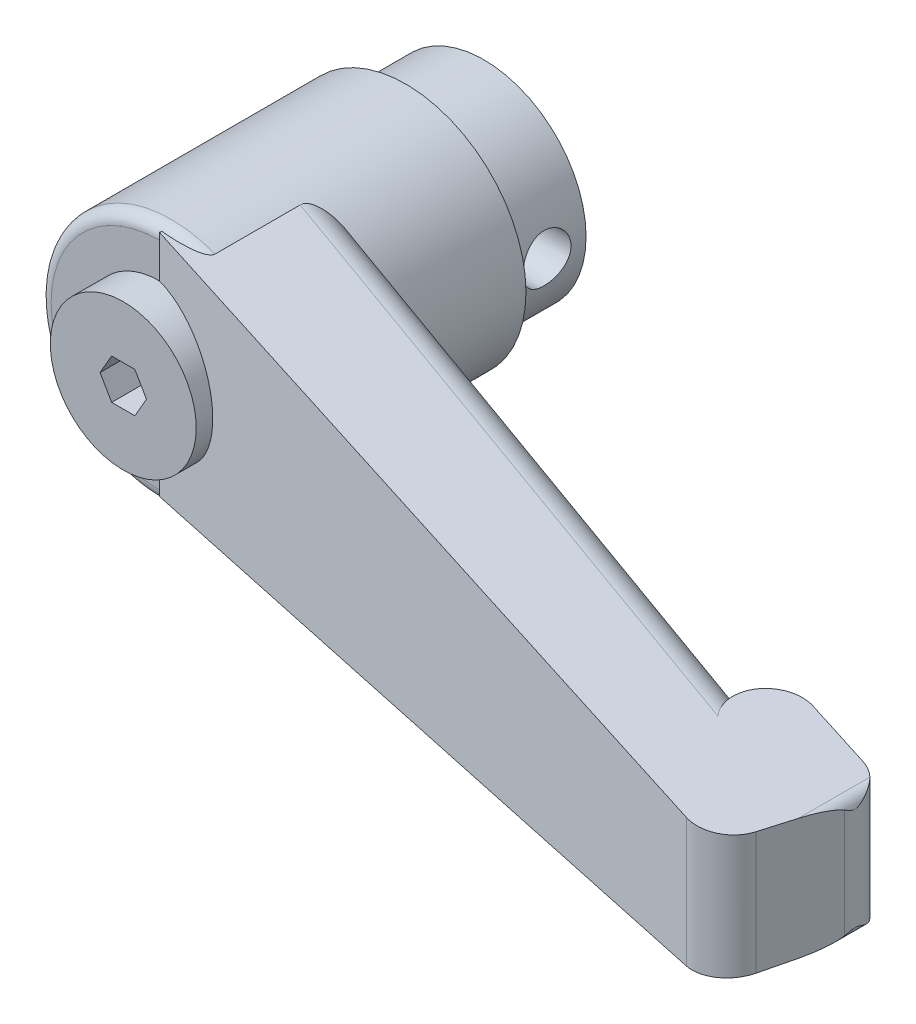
ISO-10303-21;
HEADER;
FILE_DESCRIPTION(('STEP AP214'),'2;1');
FILE_NAME('part.step','',(''),(''),'','','');
FILE_SCHEMA(('AUTOMOTIVE_DESIGN { 1 0 10303 214 1 1 1 1 }'));
ENDSEC;
DATA;
#1=APPLICATION_CONTEXT('core data for automotive mechanical design processes');
#2=APPLICATION_PROTOCOL_DEFINITION('international standard','automotive_design',2000,#1);
#3=PRODUCT_CONTEXT('',#1,'mechanical');
#4=PRODUCT('Part','Part','',(#3));
#5=PRODUCT_RELATED_PRODUCT_CATEGORY('part','',(#4));
#6=PRODUCT_DEFINITION_FORMATION('','',#4);
#7=PRODUCT_DEFINITION_CONTEXT('part definition',#1,'design');
#8=PRODUCT_DEFINITION('design','',#6,#7);
#9=PRODUCT_DEFINITION_SHAPE('','',#8);
#10=(LENGTH_UNIT() NAMED_UNIT(*) SI_UNIT(.MILLI.,.METRE.));
#11=(NAMED_UNIT(*) PLANE_ANGLE_UNIT() SI_UNIT($,.RADIAN.));
#12=(NAMED_UNIT(*) SI_UNIT($,.STERADIAN.) SOLID_ANGLE_UNIT());
#13=UNCERTAINTY_MEASURE_WITH_UNIT(LENGTH_MEASURE(1.E-05),#10,'distance_accuracy_value','');
#14=(GEOMETRIC_REPRESENTATION_CONTEXT(3) GLOBAL_UNCERTAINTY_ASSIGNED_CONTEXT((#13)) GLOBAL_UNIT_ASSIGNED_CONTEXT((#10,
#11,#12)) REPRESENTATION_CONTEXT('',''));
#15=CARTESIAN_POINT('',(0.,0.,0.));
#16=DIRECTION('',(0.,0.,1.));
#17=DIRECTION('',(1.,0.,0.));
#18=AXIS2_PLACEMENT_3D('',#15,#16,#17);
#19=CARTESIAN_POINT('',(1.18894013E-05,0.,27.0000000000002));
#20=DIRECTION('',(0.,0.,1.));
#21=DIRECTION('',(1.,0.,0.));
#22=AXIS2_PLACEMENT_3D('',#19,#20,#21);
#23=PLANE('',#22);
#24=DIRECTION('',(1.,0.,0.));
#25=VECTOR('',#24,1.);
#26=CARTESIAN_POINT('',(0.9650118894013,-1.67142902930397,27.0000000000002));
#27=LINE('',#26,#25);
#28=CARTESIAN_POINT('',(-0.9649881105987,-1.67142902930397,27.0000000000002));
#29=VERTEX_POINT('',#28);
#30=CARTESIAN_POINT('',(0.9650118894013,-1.67142902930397,27.0000000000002));
#31=VERTEX_POINT('',#30);
#32=EDGE_CURVE('E539',#29,#31,#27,.T.);
#33=ORIENTED_EDGE('',*,*,#32,.T.);
#34=DIRECTION('',(0.5,0.866025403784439,0.));
#35=VECTOR('',#34,1.);
#36=CARTESIAN_POINT('',(1.9300118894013,0.,27.0000000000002));
#37=LINE('',#36,#35);
#38=CARTESIAN_POINT('',(1.9300118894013,0.,27.0000000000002));
#39=VERTEX_POINT('',#38);
#40=EDGE_CURVE('E372',#31,#39,#37,.T.);
#41=ORIENTED_EDGE('',*,*,#40,.T.);
#42=DIRECTION('',(-0.5,0.866025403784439,0.));
#43=VECTOR('',#42,1.);
#44=CARTESIAN_POINT('',(0.9650118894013,1.67142902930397,27.0000000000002));
#45=LINE('',#44,#43);
#46=CARTESIAN_POINT('',(0.9650118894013,1.67142902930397,27.0000000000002));
#47=VERTEX_POINT('',#46);
#48=EDGE_CURVE('E568',#39,#47,#45,.T.);
#49=ORIENTED_EDGE('',*,*,#48,.T.);
#50=DIRECTION('',(1.,0.,0.));
#51=VECTOR('',#50,1.);
#52=CARTESIAN_POINT('',(-0.9649881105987,1.67142902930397,27.0000000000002));
#53=LINE('',#52,#51);
#54=CARTESIAN_POINT('',(-0.9649881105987,1.67142902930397,27.0000000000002));
#55=VERTEX_POINT('',#54);
#56=EDGE_CURVE('E563',#47,#55,#53,.F.);
#57=ORIENTED_EDGE('',*,*,#56,.T.);
#58=DIRECTION('',(-0.5,-0.866025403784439,0.));
#59=VECTOR('',#58,1.);
#60=CARTESIAN_POINT('',(-1.9299881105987,0.,27.0000000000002));
#61=LINE('',#60,#59);
#62=CARTESIAN_POINT('',(-1.9299881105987,0.,27.0000000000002));
#63=VERTEX_POINT('',#62);
#64=EDGE_CURVE('E559',#55,#63,#61,.T.);
#65=ORIENTED_EDGE('',*,*,#64,.T.);
#66=DIRECTION('',(0.5,-0.866025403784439,0.));
#67=VECTOR('',#66,1.);
#68=CARTESIAN_POINT('',(-0.9649881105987,-1.67142902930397,27.0000000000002));
#69=LINE('',#68,#67);
#70=EDGE_CURVE('E543',#63,#29,#69,.T.);
#71=ORIENTED_EDGE('',*,*,#70,.T.);
#72=EDGE_LOOP('',(#33,#41,#49,#57,#65,#71));
#73=FACE_BOUND('',#72,.T.);
#74=ADVANCED_FACE('F16',(#73),#23,.T.);
#75=CARTESIAN_POINT('',(3.,0.,14.));
#76=DIRECTION('',(0.,0.,1.));
#77=DIRECTION('',(1.,0.,0.));
#78=AXIS2_PLACEMENT_3D('',#75,#76,#77);
#79=PLANE('',#78);
#80=CARTESIAN_POINT('',(0.,0.,14.));
#81=DIRECTION('',(0.,0.,1.));
#82=DIRECTION('',(1.,0.,0.));
#83=AXIS2_PLACEMENT_3D('',#80,#81,#82);
#84=CIRCLE('',#83,3.);
#85=CARTESIAN_POINT('',(3.,0.,14.));
#86=VERTEX_POINT('',#85);
#87=EDGE_CURVE('E19',#86,#86,#84,.F.);
#88=ORIENTED_EDGE('',*,*,#87,.T.);
#89=EDGE_LOOP('',(#88));
#90=FACE_BOUND('',#89,.T.);
#91=ADVANCED_FACE('F334',(#90),#79,.F.);
#92=CARTESIAN_POINT('',(1.9300118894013,0.,27.0000000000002));
#93=DIRECTION('',(0.866025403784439,-0.5,0.));
#94=DIRECTION('',(0.5,0.866025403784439,0.));
#95=AXIS2_PLACEMENT_3D('',#92,#93,#94);
#96=PLANE('',#95);
#97=DIRECTION('',(0.,0.,1.));
#98=VECTOR('',#97,1.);
#99=CARTESIAN_POINT('',(1.9300118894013,0.,27.0000000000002));
#100=LINE('',#99,#98);
#101=CARTESIAN_POINT('',(1.9300118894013,0.,30.0000000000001));
#102=VERTEX_POINT('',#101);
#103=EDGE_CURVE('E549',#102,#39,#100,.F.);
#104=ORIENTED_EDGE('',*,*,#103,.T.);
#105=ORIENTED_EDGE('',*,*,#40,.F.);
#106=DIRECTION('',(0.,0.,-1.));
#107=VECTOR('',#106,1.);
#108=CARTESIAN_POINT('',(0.9650118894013,-1.67142902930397,27.0000000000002));
#109=LINE('',#108,#107);
#110=CARTESIAN_POINT('',(0.9650118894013,-1.67142902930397,30.0000000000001));
#111=VERTEX_POINT('',#110);
#112=EDGE_CURVE('E546',#31,#111,#109,.F.);
#113=ORIENTED_EDGE('',*,*,#112,.T.);
#114=DIRECTION('',(-0.5,-0.866025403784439,0.));
#115=VECTOR('',#114,1.);
#116=CARTESIAN_POINT('',(1.9300118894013,0.,30.0000000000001));
#117=LINE('',#116,#115);
#118=EDGE_CURVE('E572',#102,#111,#117,.T.);
#119=ORIENTED_EDGE('',*,*,#118,.F.);
#120=EDGE_LOOP('',(#104,#105,#113,#119));
#121=FACE_BOUND('',#120,.T.);
#122=ADVANCED_FACE('F331',(#121),#96,.F.);
#123=CARTESIAN_POINT('',(0.9650118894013,-1.67142902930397,27.0000000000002));
#124=DIRECTION('',(0.,-1.,0.));
#125=DIRECTION('',(0.,0.,-1.));
#126=AXIS2_PLACEMENT_3D('',#123,#124,#125);
#127=PLANE('',#126);
#128=ORIENTED_EDGE('',*,*,#112,.F.);
#129=ORIENTED_EDGE('',*,*,#32,.F.);
#130=DIRECTION('',(0.,0.,1.));
#131=VECTOR('',#130,1.);
#132=CARTESIAN_POINT('',(-0.9649881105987,-1.67142902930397,27.0000000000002));
#133=LINE('',#132,#131);
#134=CARTESIAN_POINT('',(-0.9649881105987,-1.67142902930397,30.0000000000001));
#135=VERTEX_POINT('',#134);
#136=EDGE_CURVE('E555',#29,#135,#133,.T.);
#137=ORIENTED_EDGE('',*,*,#136,.T.);
#138=DIRECTION('',(1.,0.,0.));
#139=VECTOR('',#138,1.);
#140=CARTESIAN_POINT('',(-3.034615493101,-1.67142902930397,30.0000000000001));
#141=LINE('',#140,#139);
#142=EDGE_CURVE('E552',#111,#135,#141,.F.);
#143=ORIENTED_EDGE('',*,*,#142,.F.);
#144=EDGE_LOOP('',(#128,#129,#137,#143));
#145=FACE_BOUND('',#144,.T.);
#146=ADVANCED_FACE('F327',(#145),#127,.F.);
#147=CARTESIAN_POINT('',(-0.9649881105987,-1.67142902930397,27.0000000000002));
#148=DIRECTION('',(-0.866025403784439,-0.5,0.));
#149=DIRECTION('',(0.5,-0.866025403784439,0.));
#150=AXIS2_PLACEMENT_3D('',#147,#148,#149);
#151=PLANE('',#150);
#152=ORIENTED_EDGE('',*,*,#136,.F.);
#153=ORIENTED_EDGE('',*,*,#70,.F.);
#154=DIRECTION('',(0.,0.,1.));
#155=VECTOR('',#154,1.);
#156=CARTESIAN_POINT('',(-1.9299881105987,0.,27.0000000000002));
#157=LINE('',#156,#155);
#158=CARTESIAN_POINT('',(-1.9299881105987,0.,30.0000000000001));
#159=VERTEX_POINT('',#158);
#160=EDGE_CURVE('E561',#63,#159,#157,.T.);
#161=ORIENTED_EDGE('',*,*,#160,.T.);
#162=DIRECTION('',(-0.5,0.866025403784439,0.));
#163=VECTOR('',#162,1.);
#164=CARTESIAN_POINT('',(-0.9649881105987,-1.67142902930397,30.0000000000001));
#165=LINE('',#164,#163);
#166=EDGE_CURVE('E575',#135,#159,#165,.T.);
#167=ORIENTED_EDGE('',*,*,#166,.F.);
#168=EDGE_LOOP('',(#152,#153,#161,#167));
#169=FACE_BOUND('',#168,.T.);
#170=ADVANCED_FACE('F323',(#169),#151,.F.);
#171=CARTESIAN_POINT('',(-1.9299881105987,0.,27.0000000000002));
#172=DIRECTION('',(-0.866025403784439,0.5,0.));
#173=DIRECTION('',(-0.5,-0.866025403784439,0.));
#174=AXIS2_PLACEMENT_3D('',#171,#172,#173);
#175=PLANE('',#174);
#176=ORIENTED_EDGE('',*,*,#160,.F.);
#177=ORIENTED_EDGE('',*,*,#64,.F.);
#178=DIRECTION('',(0.,0.,1.));
#179=VECTOR('',#178,1.);
#180=CARTESIAN_POINT('',(-0.9649881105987,1.67142902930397,27.0000000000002));
#181=LINE('',#180,#179);
#182=CARTESIAN_POINT('',(-0.9649881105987,1.67142902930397,30.0000000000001));
#183=VERTEX_POINT('',#182);
#184=EDGE_CURVE('E565',#55,#183,#181,.T.);
#185=ORIENTED_EDGE('',*,*,#184,.T.);
#186=DIRECTION('',(0.5,0.866025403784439,0.));
#187=VECTOR('',#186,1.);
#188=CARTESIAN_POINT('',(-1.9299881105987,0.,30.0000000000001));
#189=LINE('',#188,#187);
#190=EDGE_CURVE('E578',#159,#183,#189,.T.);
#191=ORIENTED_EDGE('',*,*,#190,.F.);
#192=EDGE_LOOP('',(#176,#177,#185,#191));
#193=FACE_BOUND('',#192,.T.);
#194=ADVANCED_FACE('F319',(#193),#175,.F.);
#195=CARTESIAN_POINT('',(-0.9649881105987,1.67142902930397,27.0000000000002));
#196=DIRECTION('',(0.,1.,0.));
#197=DIRECTION('',(0.,0.,1.));
#198=AXIS2_PLACEMENT_3D('',#195,#196,#197);
#199=PLANE('',#198);
#200=ORIENTED_EDGE('',*,*,#184,.F.);
#201=ORIENTED_EDGE('',*,*,#56,.F.);
#202=DIRECTION('',(0.,0.,1.));
#203=VECTOR('',#202,1.);
#204=CARTESIAN_POINT('',(0.9650118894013,1.67142902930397,27.0000000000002));
#205=LINE('',#204,#203);
#206=CARTESIAN_POINT('',(0.9650118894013,1.67142902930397,30.0000000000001));
#207=VERTEX_POINT('',#206);
#208=EDGE_CURVE('E570',#47,#207,#205,.T.);
#209=ORIENTED_EDGE('',*,*,#208,.T.);
#210=DIRECTION('',(1.,0.,0.));
#211=VECTOR('',#210,1.);
#212=CARTESIAN_POINT('',(-3.034615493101,1.67142902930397,30.0000000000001));
#213=LINE('',#212,#211);
#214=EDGE_CURVE('E581',#183,#207,#213,.T.);
#215=ORIENTED_EDGE('',*,*,#214,.F.);
#216=EDGE_LOOP('',(#200,#201,#209,#215));
#217=FACE_BOUND('',#216,.T.);
#218=ADVANCED_FACE('F315',(#217),#199,.F.);
#219=CARTESIAN_POINT('',(0.9650118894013,1.67142902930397,27.0000000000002));
#220=DIRECTION('',(0.866025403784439,0.5,0.));
#221=DIRECTION('',(-0.5,0.866025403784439,0.));
#222=AXIS2_PLACEMENT_3D('',#219,#220,#221);
#223=PLANE('',#222);
#224=ORIENTED_EDGE('',*,*,#208,.F.);
#225=ORIENTED_EDGE('',*,*,#48,.F.);
#226=ORIENTED_EDGE('',*,*,#103,.F.);
#227=DIRECTION('',(0.5,-0.866025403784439,0.));
#228=VECTOR('',#227,1.);
#229=CARTESIAN_POINT('',(0.9650118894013,1.67142902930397,30.0000000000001));
#230=LINE('',#229,#228);
#231=EDGE_CURVE('E306',#207,#102,#230,.T.);
#232=ORIENTED_EDGE('',*,*,#231,.F.);
#233=EDGE_LOOP('',(#224,#225,#226,#232));
#234=FACE_BOUND('',#233,.T.);
#235=ADVANCED_FACE('F311',(#234),#223,.F.);
#236=CARTESIAN_POINT('',(0.,0.,0.));
#237=DIRECTION('',(0.,0.,1.));
#238=DIRECTION('',(1.,0.,0.));
#239=AXIS2_PLACEMENT_3D('',#236,#237,#238);
#240=CYLINDRICAL_SURFACE('',#239,3.);
#241=CARTESIAN_POINT('',(0.,0.,0.));
#242=DIRECTION('',(0.,0.,1.));
#243=DIRECTION('',(1.,0.,0.));
#244=AXIS2_PLACEMENT_3D('',#241,#242,#243);
#245=CIRCLE('',#244,3.);
#246=CARTESIAN_POINT('',(3.,0.,0.));
#247=VERTEX_POINT('',#246);
#248=EDGE_CURVE('E139',#247,#247,#245,.T.);
#249=ORIENTED_EDGE('',*,*,#248,.F.);
#250=EDGE_LOOP('',(#249));
#251=FACE_BOUND('',#250,.T.);
#252=CARTESIAN_POINT('',(2.27225732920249,1.95878703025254,3.25));
#253=CARTESIAN_POINT('',(2.27227281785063,1.95877792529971,3.34832936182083));
#254=CARTESIAN_POINT('',(2.27862761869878,1.9514709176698,3.44673453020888));
#255=CARTESIAN_POINT('',(2.30283786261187,1.92282565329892,3.64007648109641));
#256=CARTESIAN_POINT('',(2.32071605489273,1.90145963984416,3.73500600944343));
#257=CARTESIAN_POINT('',(2.36480475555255,1.84632572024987,3.91802563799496));
#258=CARTESIAN_POINT('',(2.39093702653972,1.8126738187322,4.00617066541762));
#259=CARTESIAN_POINT('',(2.44841956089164,1.73424425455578,4.17545415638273));
#260=CARTESIAN_POINT('',(2.47977088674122,1.68946432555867,4.25659118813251));
#261=CARTESIAN_POINT('',(2.54972923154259,1.58226393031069,4.42282119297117));
#262=CARTESIAN_POINT('',(2.58872091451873,1.51820835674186,4.50669837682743));
#263=CARTESIAN_POINT('',(2.66622905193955,1.37756457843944,4.66356967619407));
#264=CARTESIAN_POINT('',(2.70474503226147,1.30096480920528,4.73655362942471));
#265=CARTESIAN_POINT('',(2.78287714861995,1.1251722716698,4.87910108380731));
#266=CARTESIAN_POINT('',(2.82197043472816,1.02433270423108,4.94694900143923));
#267=CARTESIAN_POINT('',(2.89089871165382,0.809550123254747,5.06414211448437));
#268=CARTESIAN_POINT('',(2.92074445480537,0.69562254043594,5.11350881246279));
#269=CARTESIAN_POINT('',(2.96462255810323,0.471701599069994,5.1862712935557));
#270=CARTESIAN_POINT('',(2.98007329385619,0.362748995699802,5.21199194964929));
#271=CARTESIAN_POINT('',(2.99873499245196,0.141087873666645,5.24481181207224));
#272=CARTESIAN_POINT('',(3.00196014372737,0.0283838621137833,5.25193260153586));
#273=CARTESIAN_POINT('',(2.99615060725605,-0.17978649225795,5.24750496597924));
#274=CARTESIAN_POINT('',(2.98883482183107,-0.275370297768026,5.23852710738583));
#275=CARTESIAN_POINT('',(2.96552996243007,-0.463236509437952,5.20728417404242));
#276=CARTESIAN_POINT('',(2.9495400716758,-0.555518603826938,5.18501784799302));
#277=CARTESIAN_POINT('',(2.91006465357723,-0.73484283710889,5.12823430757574));
#278=CARTESIAN_POINT('',(2.88655360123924,-0.821865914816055,5.09367532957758));
#279=CARTESIAN_POINT('',(2.83371230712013,-0.988812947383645,5.01369793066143));
#280=CARTESIAN_POINT('',(2.80438099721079,-1.06873559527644,4.96827751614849));
#281=CARTESIAN_POINT('',(2.73743953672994,-1.2309055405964,4.86100344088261));
#282=CARTESIAN_POINT('',(2.69924590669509,-1.31198617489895,4.79775399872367));
#283=CARTESIAN_POINT('',(2.62044947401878,-1.46305276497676,4.66025805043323));
#284=CARTESIAN_POINT('',(2.57984279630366,-1.53302017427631,4.58599355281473));
#285=CARTESIAN_POINT('',(2.492934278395,-1.67120673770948,4.4149309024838));
#286=CARTESIAN_POINT('',(2.44674683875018,-1.73740122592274,4.31642644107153));
#287=CARTESIAN_POINT('',(2.36103579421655,-1.85219849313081,4.10704237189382));
#288=CARTESIAN_POINT('',(2.32149975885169,-1.9008342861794,3.99618650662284));
#289=CARTESIAN_POINT('',(2.2660703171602,-1.96626053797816,3.79905869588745));
#290=CARTESIAN_POINT('',(2.2466429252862,-1.98823467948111,3.7155109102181));
#291=CARTESIAN_POINT('',(2.21696838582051,-2.02127576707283,3.54475704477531));
#292=CARTESIAN_POINT('',(2.20670501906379,-2.03236198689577,3.45755771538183));
#293=CARTESIAN_POINT('',(2.19693996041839,-2.04291849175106,3.28142498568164));
#294=CARTESIAN_POINT('',(2.19748766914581,-2.04233545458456,3.19248548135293));
#295=CARTESIAN_POINT('',(2.20937420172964,-2.0294661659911,3.01616989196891));
#296=CARTESIAN_POINT('',(2.2207208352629,-2.01717144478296,2.92879498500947));
#297=CARTESIAN_POINT('',(2.25159433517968,-1.98262857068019,2.76237988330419));
#298=CARTESIAN_POINT('',(2.27067935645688,-1.96091418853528,2.68314160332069));
#299=CARTESIAN_POINT('',(2.31478326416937,-1.90865071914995,2.52938861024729));
#300=CARTESIAN_POINT('',(2.33980671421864,-1.87809483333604,2.45487758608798));
#301=CARTESIAN_POINT('',(2.40686836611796,-1.79199000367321,2.27587381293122));
#302=CARTESIAN_POINT('',(2.4512322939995,-1.73153315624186,2.17459943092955));
#303=CARTESIAN_POINT('',(2.54248890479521,-1.59453789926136,1.98472407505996));
#304=CARTESIAN_POINT('',(2.58938616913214,-1.51796957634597,1.89614719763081));
#305=CARTESIAN_POINT('',(2.68127723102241,-1.34910352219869,1.73231295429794));
#306=CARTESIAN_POINT('',(2.72625032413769,-1.25667160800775,1.65718141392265));
#307=CARTESIAN_POINT('',(2.80934969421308,-1.05787643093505,1.52353686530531));
#308=CARTESIAN_POINT('',(2.84748962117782,-0.951541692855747,1.46499058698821));
#309=CARTESIAN_POINT('',(2.90581013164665,-0.751446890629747,1.37789687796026));
#310=CARTESIAN_POINT('',(2.9280903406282,-0.659928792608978,1.34560166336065));
#311=CARTESIAN_POINT('',(2.96424412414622,-0.471616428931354,1.29443088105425));
#312=CARTESIAN_POINT('',(2.97812330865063,-0.374825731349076,1.2755463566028));
#313=CARTESIAN_POINT('',(2.99632990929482,-0.178264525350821,1.25224075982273));
#314=CARTESIAN_POINT('',(3.00062410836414,-0.0784848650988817,1.24786995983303));
#315=CARTESIAN_POINT('',(2.99922849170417,0.120541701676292,1.25406750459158));
#316=CARTESIAN_POINT('',(2.99353836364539,0.219788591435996,1.2646363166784));
#317=CARTESIAN_POINT('',(2.97340310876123,0.409208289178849,1.2991337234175));
#318=CARTESIAN_POINT('',(2.95946098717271,0.499579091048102,1.32228895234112));
#319=CARTESIAN_POINT('',(2.92445151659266,0.674973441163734,1.38034286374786));
#320=CARTESIAN_POINT('',(2.90338295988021,0.75999608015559,1.41524353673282));
#321=CARTESIAN_POINT('',(2.85386925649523,0.929408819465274,1.49857969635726));
#322=CARTESIAN_POINT('',(2.82498569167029,1.01326141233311,1.54784123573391));
#323=CARTESIAN_POINT('',(2.76293271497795,1.17195434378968,1.65704098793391));
#324=CARTESIAN_POINT('',(2.72976003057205,1.24678771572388,1.71698736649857));
#325=CARTESIAN_POINT('',(2.65596691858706,1.39784774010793,1.85668924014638));
#326=CARTESIAN_POINT('',(2.61500192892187,1.47239692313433,1.93807911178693));
#327=CARTESIAN_POINT('',(2.53423655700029,1.60743148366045,2.11240104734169));
#328=CARTESIAN_POINT('',(2.49443667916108,1.6679108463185,2.20533802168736));
#329=CARTESIAN_POINT('',(2.42549421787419,1.76637978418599,2.38863868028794));
#330=CARTESIAN_POINT('',(2.39563822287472,1.80629183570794,2.47769664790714));
#331=CARTESIAN_POINT('',(2.34377734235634,1.8731021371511,2.66263015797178));
#332=CARTESIAN_POINT('',(2.32175237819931,1.90003373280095,2.75848749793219));
#333=CARTESIAN_POINT('',(2.29462933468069,1.93260274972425,2.92085067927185));
#334=CARTESIAN_POINT('',(2.28630984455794,1.94238610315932,2.98600424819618));
#335=CARTESIAN_POINT('',(2.2751188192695,1.95548107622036,3.11742711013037));
#336=CARTESIAN_POINT('',(2.27224688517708,1.95879316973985,3.18369632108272));
#337=CARTESIAN_POINT('',(2.27225732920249,1.95878703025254,3.25));
#338=B_SPLINE_CURVE_WITH_KNOTS('',3,(#252,#253,#254,#255,#256,#257,#258,#259,#260,#261,#262,
#263,#264,#265,#266,#267,#268,#269,#270,#271,#272,#273,#274,#275,#276,#277,#278,#279,#280,#281,
#282,#283,#284,#285,#286,#287,#288,#289,#290,#291,#292,#293,#294,#295,#296,#297,#298,#299,#300,
#301,#302,#303,#304,#305,#306,#307,#308,#309,#310,#311,#312,#313,#314,#315,#316,#317,#318,#319,
#320,#321,#322,#323,#324,#325,#326,#327,#328,#329,#330,#331,#332,#333,#334,#335,#336,#337),
.UNSPECIFIED.,.T.,.F.,(4,2,2,2,2,2,2,2,2,2,2,2,2,2,2,2,2,2,2,2,2,2,2,2,2,2,2,2,2,2,2,2,2,2,2,2,
2,2,2,2,2,2,4),(0.,0.294684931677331,0.589953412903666,0.882503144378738,1.17511250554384,
1.51137706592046,1.84795339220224,2.22884509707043,2.60929225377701,2.94621936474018,
3.28275533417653,3.57022504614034,3.85772183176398,4.14620485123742,4.4347408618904,
4.76258556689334,5.0909717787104,5.47126744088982,5.85084429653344,6.1154492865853,
6.37958502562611,6.64492799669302,6.91046300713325,7.16259400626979,7.41491939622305,
7.79099737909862,8.16777986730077,8.54792243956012,8.92729695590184,9.22476135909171,
9.52202690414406,9.82032104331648,10.1186245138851,10.4003856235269,10.6821945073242,
10.9853864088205,11.2888110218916,11.6405767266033,11.9924925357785,12.2975400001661,
12.6017995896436,12.8005207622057,12.9992273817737),.UNSPECIFIED.);
#339=CARTESIAN_POINT('',(2.27225732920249,1.95878703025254,3.25));
#340=VERTEX_POINT('',#339);
#341=EDGE_CURVE('E301',#340,#340,#338,.T.);
#342=ORIENTED_EDGE('',*,*,#341,.T.);
#343=EDGE_LOOP('',(#342));
#344=FACE_BOUND('',#343,.T.);
#345=ORIENTED_EDGE('',*,*,#87,.F.);
#346=EDGE_LOOP('',(#345));
#347=FACE_BOUND('',#346,.T.);
#348=ADVANCED_FACE('F307',(#251,#344,#347),#240,.F.);
#349=CARTESIAN_POINT('',(-3.034615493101,0.,30.0000000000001));
#350=DIRECTION('',(0.,0.,1.));
#351=DIRECTION('',(1.,0.,0.));
#352=AXIS2_PLACEMENT_3D('',#349,#350,#351);
#353=PLANE('',#352);
#354=ORIENTED_EDGE('',*,*,#214,.T.);
#355=ORIENTED_EDGE('',*,*,#231,.T.);
#356=ORIENTED_EDGE('',*,*,#118,.T.);
#357=ORIENTED_EDGE('',*,*,#142,.T.);
#358=ORIENTED_EDGE('',*,*,#166,.T.);
#359=ORIENTED_EDGE('',*,*,#190,.T.);
#360=EDGE_LOOP('',(#354,#355,#356,#357,#358,#359));
#361=FACE_BOUND('',#360,.T.);
#362=CARTESIAN_POINT('',(0.,0.,30.0000000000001));
#363=DIRECTION('',(0.,0.,1.));
#364=DIRECTION('',(1.,0.,0.));
#365=AXIS2_PLACEMENT_3D('',#362,#363,#364);
#366=CIRCLE('',#365,6.06923098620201);
#367=CARTESIAN_POINT('',(6.06923098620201,0.,30.0000000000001));
#368=VERTEX_POINT('',#367);
#369=EDGE_CURVE('E291',#368,#368,#366,.F.);
#370=ORIENTED_EDGE('',*,*,#369,.F.);
#371=EDGE_LOOP('',(#370));
#372=FACE_BOUND('',#371,.T.);
#373=ADVANCED_FACE('F297',(#361,#372),#353,.T.);
#374=CARTESIAN_POINT('',(0.,-0.041212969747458,3.25));
#375=DIRECTION('',(1.,0.,0.));
#376=DIRECTION('',(0.,0.,-1.));
#377=AXIS2_PLACEMENT_3D('',#374,#375,#376);
#378=CYLINDRICAL_SURFACE('',#377,2.);
#379=CARTESIAN_POINT('',(8.27122441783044,1.95878703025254,3.25));
#380=CARTESIAN_POINT('',(8.27122660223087,1.95878354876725,3.13925838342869));
#381=CARTESIAN_POINT('',(8.2734266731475,1.94955812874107,3.02847659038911));
#382=CARTESIAN_POINT('',(8.28196661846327,1.9129479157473,2.81007676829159));
#383=CARTESIAN_POINT('',(8.28830917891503,1.88555134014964,2.70246083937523));
#384=CARTESIAN_POINT('',(8.3043669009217,1.81351618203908,2.49358087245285));
#385=CARTESIAN_POINT('',(8.31407814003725,1.76889764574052,2.39230960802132));
#386=CARTESIAN_POINT('',(8.33575624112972,1.66374202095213,2.19868180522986));
#387=CARTESIAN_POINT('',(8.34772312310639,1.60320479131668,2.10632534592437));
#388=CARTESIAN_POINT('',(8.37279122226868,1.4667139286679,1.93141419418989));
#389=CARTESIAN_POINT('',(8.38590819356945,1.39051701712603,1.84905155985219));
#390=CARTESIAN_POINT('',(8.41162194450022,1.22539224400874,1.69815533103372));
#391=CARTESIAN_POINT('',(8.42421868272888,1.13646337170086,1.62962283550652));
#392=CARTESIAN_POINT('',(8.44760832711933,0.947152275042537,1.50760072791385));
#393=CARTESIAN_POINT('',(8.45837936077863,0.84665252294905,1.45428890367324));
#394=CARTESIAN_POINT('',(8.47668276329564,0.637824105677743,1.3653828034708));
#395=CARTESIAN_POINT('',(8.48421556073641,0.529496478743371,1.32978618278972));
#396=CARTESIAN_POINT('',(8.49503471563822,0.310184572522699,1.27794931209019));
#397=CARTESIAN_POINT('',(8.49839585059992,0.199284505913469,1.26136862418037));
#398=CARTESIAN_POINT('',(8.50069804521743,-0.0237660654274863,1.24695695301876));
#399=CARTESIAN_POINT('',(8.49963966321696,-0.135916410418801,1.24912360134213));
#400=CARTESIAN_POINT('',(8.49324042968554,-0.356049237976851,1.27189643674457));
#401=CARTESIAN_POINT('',(8.48798072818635,-0.464070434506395,1.29215405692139));
#402=CARTESIAN_POINT('',(8.47380679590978,-0.675124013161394,1.34996565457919));
#403=CARTESIAN_POINT('',(8.46489236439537,-0.778156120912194,1.38752058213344));
#404=CARTESIAN_POINT('',(8.44421806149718,-0.977402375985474,1.47921250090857));
#405=CARTESIAN_POINT('',(8.4324326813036,-1.07354480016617,1.53349937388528));
#406=CARTESIAN_POINT('',(8.40727150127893,-1.25548140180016,1.65700107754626));
#407=CARTESIAN_POINT('',(8.39389544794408,-1.34127392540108,1.72621828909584));
#408=CARTESIAN_POINT('',(8.36660027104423,-1.50227801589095,1.87961684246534));
#409=CARTESIAN_POINT('',(8.35267585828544,-1.57718057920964,1.9641219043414));
#410=CARTESIAN_POINT('',(8.32612960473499,-1.71180837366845,2.14465379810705));
#411=CARTESIAN_POINT('',(8.31350780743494,-1.77153309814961,2.2406810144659));
#412=CARTESIAN_POINT('',(8.2909609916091,-1.87423376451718,2.44201285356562));
#413=CARTESIAN_POINT('',(8.28104478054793,-1.91715519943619,2.54734633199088));
#414=CARTESIAN_POINT('',(8.26514551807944,-1.98458628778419,2.76402893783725));
#415=CARTESIAN_POINT('',(8.25916169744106,-2.00909954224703,2.87537688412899));
#416=CARTESIAN_POINT('',(8.25195199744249,-2.03850772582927,3.09798775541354));
#417=CARTESIAN_POINT('',(8.25061254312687,-2.04387105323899,3.20918520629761));
#418=CARTESIAN_POINT('',(8.25253329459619,-2.03610168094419,3.4308848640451));
#419=CARTESIAN_POINT('',(8.2557931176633,-2.02297052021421,3.5413871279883));
#420=CARTESIAN_POINT('',(8.26644419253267,-1.97898833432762,3.75690117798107));
#421=CARTESIAN_POINT('',(8.27377457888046,-1.94839818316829,3.86196949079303));
#422=CARTESIAN_POINT('',(8.29169702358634,-1.87065282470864,4.06548737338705));
#423=CARTESIAN_POINT('',(8.30228944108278,-1.82349579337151,4.16393621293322));
#424=CARTESIAN_POINT('',(8.32580261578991,-1.71296503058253,4.35340038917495));
#425=CARTESIAN_POINT('',(8.33876232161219,-1.6493111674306,4.44424736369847));
#426=CARTESIAN_POINT('',(8.36547822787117,-1.50795785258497,4.61413885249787));
#427=CARTESIAN_POINT('',(8.37923454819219,-1.43025628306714,4.69318158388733));
#428=CARTESIAN_POINT('',(8.40640765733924,-1.2608808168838,4.83908364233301));
#429=CARTESIAN_POINT('',(8.41980936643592,-1.16892673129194,4.90562104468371));
#430=CARTESIAN_POINT('',(8.44447464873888,-0.974884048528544,5.02230727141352));
#431=CARTESIAN_POINT('',(8.4557383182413,-0.872795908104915,5.07245683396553));
#432=CARTESIAN_POINT('',(8.47483837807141,-0.661991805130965,5.1545588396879));
#433=CARTESIAN_POINT('',(8.48269621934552,-0.553322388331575,5.1866255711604));
#434=CARTESIAN_POINT('',(8.4942393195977,-0.331923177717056,5.23198140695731));
#435=CARTESIAN_POINT('',(8.49792529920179,-0.219194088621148,5.24527375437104));
#436=CARTESIAN_POINT('',(8.50071500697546,0.0041705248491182,5.25252881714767));
#437=CARTESIAN_POINT('',(8.499928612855,0.114789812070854,5.246956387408));
#438=CARTESIAN_POINT('',(8.49416007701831,0.333484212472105,5.21768200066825));
#439=CARTESIAN_POINT('',(8.48917805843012,0.441559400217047,5.19398057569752));
#440=CARTESIAN_POINT('',(8.47564095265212,0.65156278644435,5.12938010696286));
#441=CARTESIAN_POINT('',(8.46710485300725,0.753520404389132,5.08857244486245));
#442=CARTESIAN_POINT('',(8.44740758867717,0.949203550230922,4.99098616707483));
#443=CARTESIAN_POINT('',(8.43624613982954,1.04292818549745,4.93420582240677));
#444=CARTESIAN_POINT('',(8.4122520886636,1.22160517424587,4.80489702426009));
#445=CARTESIAN_POINT('',(8.39938943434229,1.30633324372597,4.73206423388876));
#446=CARTESIAN_POINT('',(8.37360764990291,1.46252370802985,4.57332092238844));
#447=CARTESIAN_POINT('',(8.36068850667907,1.53398283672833,4.48740719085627));
#448=CARTESIAN_POINT('',(8.33604714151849,1.66273738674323,4.30327037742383));
#449=CARTESIAN_POINT('',(8.32434773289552,1.71978426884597,4.20487023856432));
#450=CARTESIAN_POINT('',(8.30379315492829,1.81644685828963,3.99962999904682));
#451=CARTESIAN_POINT('',(8.2949357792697,1.85607609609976,3.89279652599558));
#452=CARTESIAN_POINT('',(8.28258295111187,1.91034396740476,3.69667191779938));
#453=CARTESIAN_POINT('',(8.2783540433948,1.92847313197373,3.60837633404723));
#454=CARTESIAN_POINT('',(8.27267397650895,1.95269569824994,3.43006261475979));
#455=CARTESIAN_POINT('',(8.271222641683,1.95878986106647,3.34004458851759));
#456=CARTESIAN_POINT('',(8.27122441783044,1.95878703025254,3.25));
#457=B_SPLINE_CURVE_WITH_KNOTS('',3,(#379,#380,#381,#382,#383,#384,#385,#386,#387,#388,#389,
#390,#391,#392,#393,#394,#395,#396,#397,#398,#399,#400,#401,#402,#403,#404,#405,#406,#407,#408,
#409,#410,#411,#412,#413,#414,#415,#416,#417,#418,#419,#420,#421,#422,#423,#424,#425,#426,#427,
#428,#429,#430,#431,#432,#433,#434,#435,#436,#437,#438,#439,#440,#441,#442,#443,#444,#445,#446,
#447,#448,#449,#450,#451,#452,#453,#454,#455,#456),.UNSPECIFIED.,.T.,.F.,(4,2,2,2,2,2,2,2,2,2,2,
2,2,2,2,2,2,2,2,2,2,2,2,2,2,2,2,2,2,2,2,2,2,2,2,2,2,2,4),(0.,0.331894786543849,
0.664004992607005,0.99572978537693,1.32745751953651,1.66479223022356,2.00215373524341,
2.34330815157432,2.68441740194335,3.01931954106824,3.35417937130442,3.68272326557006,
4.01128520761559,4.34288037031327,4.67452844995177,5.01426314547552,5.35400918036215,
5.69484833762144,6.03562080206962,6.36799875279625,6.70034904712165,7.02785868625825,
7.35540439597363,7.68892517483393,8.02249627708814,8.36373725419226,8.7049628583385,
9.04400693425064,9.38299243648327,9.7136862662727,10.0443703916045,10.3733100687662,
10.7022853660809,11.0381363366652,11.3740698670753,11.7154523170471,12.0565691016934,
12.3264515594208,12.5963169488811),.UNSPECIFIED.);
#458=CARTESIAN_POINT('',(8.27122441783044,1.95878703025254,3.25));
#459=VERTEX_POINT('',#458);
#460=EDGE_CURVE('E286',#459,#459,#457,.T.);
#461=ORIENTED_EDGE('',*,*,#460,.F.);
#462=EDGE_LOOP('',(#461));
#463=FACE_BOUND('',#462,.T.);
#464=ORIENTED_EDGE('',*,*,#341,.F.);
#465=EDGE_LOOP('',(#464));
#466=FACE_BOUND('',#465,.T.);
#467=ADVANCED_FACE('F293',(#463,#466),#378,.F.);
#468=CARTESIAN_POINT('',(-5.875,0.,0.));
#469=DIRECTION('',(0.,0.,-1.));
#470=DIRECTION('',(-1.,0.,0.));
#471=AXIS2_PLACEMENT_3D('',#468,#469,#470);
#472=PLANE('',#471);
#473=ORIENTED_EDGE('',*,*,#248,.T.);
#474=EDGE_LOOP('',(#473));
#475=FACE_BOUND('',#474,.T.);
#476=CARTESIAN_POINT('',(0.,0.,0.));
#477=DIRECTION('',(0.,0.,1.));
#478=DIRECTION('',(1.,0.,0.));
#479=AXIS2_PLACEMENT_3D('',#476,#477,#478);
#480=CIRCLE('',#479,8.5);
#481=CARTESIAN_POINT('',(8.5,0.,0.));
#482=VERTEX_POINT('',#481);
#483=EDGE_CURVE('E274',#482,#482,#480,.T.);
#484=ORIENTED_EDGE('',*,*,#483,.F.);
#485=EDGE_LOOP('',(#484));
#486=FACE_BOUND('',#485,.T.);
#487=ADVANCED_FACE('F264',(#475,#486),#472,.T.);
#488=CARTESIAN_POINT('',(62.216772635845,9.99999999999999,34.3534483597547));
#489=DIRECTION('',(0.,-1.,0.));
#490=DIRECTION('',(1.,0.,0.));
#491=AXIS2_PLACEMENT_3D('',#488,#489,#490);
#492=CYLINDRICAL_SURFACE('',#491,3.00000000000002);
#493=CARTESIAN_POINT('',(62.216772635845,-5.16421677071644,34.3534483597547));
#494=DIRECTION('',(-0.06883852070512,0.997627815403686,0.));
#495=DIRECTION('',(-0.997627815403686,-0.06883852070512,0.));
#496=AXIS2_PLACEMENT_3D('',#493,#494,#495);
#497=ELLIPSE('',#496,3.00713347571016,3.00000000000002);
#498=CARTESIAN_POINT('',(64.3091749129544,-5.01983639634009,32.2035988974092));
#499=VERTEX_POINT('',#498);
#500=CARTESIAN_POINT('',(62.9932297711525,-5.11063951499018,31.4556708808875));
#501=VERTEX_POINT('',#500);
#502=EDGE_CURVE('E138',#499,#501,#497,.T.);
#503=ORIENTED_EDGE('',*,*,#502,.T.);
#504=DIRECTION('',(0.,1.,0.));
#505=VECTOR('',#504,1.);
#506=CARTESIAN_POINT('',(62.9932297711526,9.99999999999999,31.4556708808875));
#507=LINE('',#506,#505);
#508=CARTESIAN_POINT('',(62.9932297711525,5.16348425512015,31.4556708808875));
#509=VERTEX_POINT('',#508);
#510=EDGE_CURVE('E136',#509,#501,#507,.F.);
#511=ORIENTED_EDGE('',*,*,#510,.F.);
#512=CARTESIAN_POINT('',(62.216772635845,5.21779692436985,34.3534483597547));
#513=DIRECTION('',(-0.069778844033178,-0.997562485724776,0.));
#514=DIRECTION('',(0.997562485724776,-0.069778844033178,0.));
#515=AXIS2_PLACEMENT_3D('',#512,#513,#514);
#516=ELLIPSE('',#515,3.00733041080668,3.00000000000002);
#517=CARTESIAN_POINT('',(64.3101156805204,5.07136894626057,32.2045149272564));
#518=VERTEX_POINT('',#517);
#519=EDGE_CURVE('E127',#509,#518,#516,.T.);
#520=ORIENTED_EDGE('',*,*,#519,.T.);
#521=CARTESIAN_POINT('',(65.1145501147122,4.55934857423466,35.1299054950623));
#522=CARTESIAN_POINT('',(65.1242489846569,4.54190310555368,35.0936951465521));
#523=CARTESIAN_POINT('',(65.133270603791,4.52441113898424,35.0573249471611));
#524=CARTESIAN_POINT('',(65.1499759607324,4.48964910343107,34.9841109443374));
#525=CARTESIAN_POINT('',(65.1576578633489,4.4723793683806,34.9472665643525));
#526=CARTESIAN_POINT('',(65.1721232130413,4.43733792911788,34.8706698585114));
#527=CARTESIAN_POINT('',(65.1788175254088,4.41960498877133,34.8308825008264));
#528=CARTESIAN_POINT('',(65.1906605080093,4.38559297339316,34.7504867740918));
#529=CARTESIAN_POINT('',(65.1958099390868,4.36931318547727,34.7098788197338));
#530=CARTESIAN_POINT('',(65.2056022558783,4.33576967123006,34.6172400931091));
#531=CARTESIAN_POINT('',(65.2098050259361,4.31925806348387,34.5648677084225));
#532=CARTESIAN_POINT('',(65.2153689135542,4.29624084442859,34.4588735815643));
#533=CARTESIAN_POINT('',(65.2168017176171,4.28948399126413,34.4053207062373));
#534=CARTESIAN_POINT('',(65.2167422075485,4.28975117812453,34.2974804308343));
#535=CARTESIAN_POINT('',(65.215207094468,4.29697685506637,34.243193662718));
#536=CARTESIAN_POINT('',(65.2093943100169,4.32089549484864,34.13621353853));
#537=CARTESIAN_POINT('',(65.2050642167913,4.3377686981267,34.0835712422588));
#538=CARTESIAN_POINT('',(65.1951074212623,4.37157301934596,33.9912643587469));
#539=CARTESIAN_POINT('',(65.1899577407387,4.38771613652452,33.9512371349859));
#540=CARTESIAN_POINT('',(65.1781573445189,4.42138368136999,33.8719847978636));
#541=CARTESIAN_POINT('',(65.1715062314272,4.43890847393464,33.8327598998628));
#542=CARTESIAN_POINT('',(65.1493041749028,4.49245504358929,33.7158200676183));
#543=CARTESIAN_POINT('',(65.1315167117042,4.52940320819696,33.6389505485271));
#544=CARTESIAN_POINT('',(65.0899836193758,4.60285303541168,33.4869413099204));
#545=CARTESIAN_POINT('',(65.0662563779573,4.63935571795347,33.4117970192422));
#546=CARTESIAN_POINT('',(65.0126682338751,4.71058575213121,33.2629353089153));
#547=CARTESIAN_POINT('',(64.9828131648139,4.74531475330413,33.189216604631));
#548=CARTESIAN_POINT('',(64.9248175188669,4.80369874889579,33.0611028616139));
#549=CARTESIAN_POINT('',(64.8980352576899,4.82798854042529,33.0063807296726));
#550=CARTESIAN_POINT('',(64.8407427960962,4.87435052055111,32.897926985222));
#551=CARTESIAN_POINT('',(64.8102317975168,4.89642223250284,32.8441955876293));
#552=CARTESIAN_POINT('',(64.7455019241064,4.93767991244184,32.7380914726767));
#553=CARTESIAN_POINT('',(64.7112939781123,4.95687400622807,32.6857152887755));
#554=CARTESIAN_POINT('',(64.6390788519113,4.99174512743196,32.5824597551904));
#555=CARTESIAN_POINT('',(64.6010737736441,5.00742408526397,32.5315795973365));
#556=CARTESIAN_POINT('',(64.5227638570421,5.03395293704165,32.4335042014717));
#557=CARTESIAN_POINT('',(64.4825979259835,5.04496131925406,32.3862423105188));
#558=CARTESIAN_POINT('',(64.3988548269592,5.06208419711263,32.2937301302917));
#559=CARTESIAN_POINT('',(64.3552703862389,5.0681879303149,32.2484844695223));
#560=CARTESIAN_POINT('',(64.3101156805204,5.07136894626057,32.2045149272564));
#561=B_SPLINE_CURVE_WITH_KNOTS('',3,(#521,#522,#523,#524,#525,#526,#527,#528,#529,#530,#531,
#532,#533,#534,#535,#536,#537,#538,#539,#540,#541,#542,#543,#544,#545,#546,#547,#548,#549,#550,
#551,#552,#553,#554,#555,#556,#557,#558,#559,#560),.UNSPECIFIED.,.F.,.F.,(4,2,2,2,2,2,2,2,2,2,2,
2,2,2,2,2,2,2,2,4),(0.,0.124036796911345,0.248242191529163,0.380407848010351,0.51250830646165,
0.677273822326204,0.837714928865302,1.00048694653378,1.16640424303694,1.29674961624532,
1.42712952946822,1.68824909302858,1.94857009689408,2.20864441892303,2.40527678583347,
2.60195131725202,2.79805957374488,2.99405986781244,3.1827398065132,3.37183265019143),.UNSPECIFIED.);
#562=CARTESIAN_POINT('',(65.1145501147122,4.55934857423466,35.1299054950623));
#563=VERTEX_POINT('',#562);
#564=EDGE_CURVE('E133',#563,#518,#561,.T.);
#565=ORIENTED_EDGE('',*,*,#564,.F.);
#566=DIRECTION('',(0.,1.,0.));
#567=VECTOR('',#566,1.);
#568=CARTESIAN_POINT('',(65.1145501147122,9.99999999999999,35.1299054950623));
#569=LINE('',#568,#567);
#570=CARTESIAN_POINT('',(65.1145501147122,-4.50774989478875,35.1299054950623));
#571=VERTEX_POINT('',#570);
#572=EDGE_CURVE('E444',#571,#563,#569,.T.);
#573=ORIENTED_EDGE('',*,*,#572,.F.);
#574=CARTESIAN_POINT('',(64.3091749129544,-5.01983639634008,32.2035988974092));
#575=CARTESIAN_POINT('',(64.3486697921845,-5.01709844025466,32.2420311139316));
#576=CARTESIAN_POINT('',(64.3869680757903,-5.01211459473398,32.2814326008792));
#577=CARTESIAN_POINT('',(64.4609695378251,-4.99829253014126,32.3618277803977));
#578=CARTESIAN_POINT('',(64.496677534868,-4.98946169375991,32.4028182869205));
#579=CARTESIAN_POINT('',(64.5993892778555,-4.95825594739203,32.5273429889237));
#580=CARTESIAN_POINT('',(64.6624935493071,-4.9311160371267,32.6129334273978));
#581=CARTESIAN_POINT('',(64.7634001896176,-4.87592198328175,32.7657297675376));
#582=CARTESIAN_POINT('',(64.8035728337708,-4.849818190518,32.8321392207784));
#583=CARTESIAN_POINT('',(64.8781059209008,-4.79384399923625,32.9666490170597));
#584=CARTESIAN_POINT('',(64.9124642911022,-4.76397226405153,33.0347499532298));
#585=CARTESIAN_POINT('',(64.9755474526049,-4.70149980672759,33.1723876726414));
#586=CARTESIAN_POINT('',(65.0042653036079,-4.6688957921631,33.2419261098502));
#587=CARTESIAN_POINT('',(65.0561867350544,-4.60201943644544,33.3822031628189));
#588=CARTESIAN_POINT('',(65.0793920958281,-4.56774763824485,33.4529413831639));
#589=CARTESIAN_POINT('',(65.1219645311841,-4.49610763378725,33.6009628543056));
#590=CARTESIAN_POINT('',(65.1409222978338,-4.45869747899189,33.6783440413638));
#591=CARTESIAN_POINT('',(65.1648440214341,-4.40390029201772,33.7962321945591));
#592=CARTESIAN_POINT('',(65.1720799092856,-4.38580330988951,33.8359497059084));
#593=CARTESIAN_POINT('',(65.1850056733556,-4.35076630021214,33.9161327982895));
#594=CARTESIAN_POINT('',(65.1906952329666,-4.33382651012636,33.9565985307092));
#595=CARTESIAN_POINT('',(65.2024963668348,-4.2956611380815,34.0553872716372));
#596=CARTESIAN_POINT('',(65.2078378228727,-4.27549596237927,34.1142772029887));
#597=CARTESIAN_POINT('',(65.2132138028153,-4.25366312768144,34.2043852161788));
#598=CARTESIAN_POINT('',(65.2145657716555,-4.24780327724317,34.2344528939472));
#599=CARTESIAN_POINT('',(65.2163577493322,-4.23992197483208,34.2950906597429));
#600=CARTESIAN_POINT('',(65.2167995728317,-4.23789288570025,34.3256596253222));
#601=CARTESIAN_POINT('',(65.2167428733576,-4.2381492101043,34.3870672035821));
#602=CARTESIAN_POINT('',(65.2162354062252,-4.24047566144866,34.4179056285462));
#603=CARTESIAN_POINT('',(65.2142990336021,-4.24895781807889,34.4790461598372));
#604=CARTESIAN_POINT('',(65.2128681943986,-4.25512155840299,34.5093470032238));
#605=CARTESIAN_POINT('',(65.2072011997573,-4.27795864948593,34.6007102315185));
#606=CARTESIAN_POINT('',(65.2015975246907,-4.29886479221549,34.6605744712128));
#607=CARTESIAN_POINT('',(65.1899196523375,-4.33609731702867,34.755607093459));
#608=CARTESIAN_POINT('',(65.1848391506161,-4.35113145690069,34.7914902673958));
#609=CARTESIAN_POINT('',(65.1734578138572,-4.38214522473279,34.8626748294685));
#610=CARTESIAN_POINT('',(65.167156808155,-4.39812498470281,34.8979761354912));
#611=CARTESIAN_POINT('',(65.1537177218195,-4.42965565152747,34.9662268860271));
#612=CARTESIAN_POINT('',(65.1466433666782,-4.44518299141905,34.9992002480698));
#613=CARTESIAN_POINT('',(65.1314109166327,-4.47639991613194,35.0647942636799));
#614=CARTESIAN_POINT('',(65.1232534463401,-4.49208940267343,35.0974151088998));
#615=CARTESIAN_POINT('',(65.1145501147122,-4.50774989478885,35.1299054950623));
#616=B_SPLINE_CURVE_WITH_KNOTS('',3,(#574,#575,#576,#577,#578,#579,#580,#581,#582,#583,#584,
#585,#586,#587,#588,#589,#590,#591,#592,#593,#594,#595,#596,#597,#598,#599,#600,#601,#602,#603,
#604,#605,#606,#607,#608,#609,#610,#611,#612,#613,#614,#615),.UNSPECIFIED.,.F.,.F.,(4,2,2,2,2,2,
2,2,2,2,2,2,2,2,2,2,2,2,2,2,4),(0.,0.165349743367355,0.330383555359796,0.658317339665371,
0.903691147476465,1.14915224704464,1.394913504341,1.64059528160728,1.90439673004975,
2.0370750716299,2.16978055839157,2.35647852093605,2.44827397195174,2.53988622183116,
2.63236598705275,2.72504005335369,2.91527803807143,3.03299557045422,3.15072957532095,
3.26209433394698,3.37339514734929),.UNSPECIFIED.);
#617=EDGE_CURVE('E268',#499,#571,#616,.T.);
#618=ORIENTED_EDGE('',*,*,#617,.F.);
#619=EDGE_LOOP('',(#503,#511,#520,#565,#573,#618));
#620=FACE_BOUND('',#619,.T.);
#621=ADVANCED_FACE('F131',(#620),#492,.T.);
#622=CARTESIAN_POINT('',(0.,0.,28.5000000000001));
#623=DIRECTION('',(0.,0.,1.));
#624=DIRECTION('',(1.,0.,0.));
#625=AXIS2_PLACEMENT_3D('',#622,#623,#624);
#626=CYLINDRICAL_SURFACE('',#625,6.06923098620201);
#627=ORIENTED_EDGE('',*,*,#369,.T.);
#628=EDGE_LOOP('',(#627));
#629=FACE_BOUND('',#628,.T.);
#630=CARTESIAN_POINT('',(0.,0.,27.0000000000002));
#631=DIRECTION('',(-0.25881904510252,0.,0.965925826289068));
#632=DIRECTION('',(0.965925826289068,0.,0.25881904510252));
#633=AXIS2_PLACEMENT_3D('',#630,#631,#632);
#634=ELLIPSE('',#633,6.28333027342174,6.06923098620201);
#635=CARTESIAN_POINT('',(-3.28973238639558E-13,6.06923098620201,27.0000000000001));
#636=VERTEX_POINT('',#635);
#637=CARTESIAN_POINT('',(-3.35367314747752E-13,-6.06923098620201,27.0000000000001));
#638=VERTEX_POINT('',#637);
#639=EDGE_CURVE('E438',#636,#638,#634,.F.);
#640=ORIENTED_EDGE('',*,*,#639,.F.);
#641=CARTESIAN_POINT('',(0.,0.,27.0000000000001));
#642=DIRECTION('',(0.,0.,1.));
#643=DIRECTION('',(1.,0.,0.));
#644=AXIS2_PLACEMENT_3D('',#641,#642,#643);
#645=CIRCLE('',#644,6.06923098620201);
#646=EDGE_CURVE('E257',#638,#636,#645,.F.);
#647=ORIENTED_EDGE('',*,*,#646,.F.);
#648=EDGE_LOOP('',(#640,#647));
#649=FACE_BOUND('',#648,.T.);
#650=ADVANCED_FACE('F263',(#629,#649),#626,.T.);
#651=CARTESIAN_POINT('',(0.,0.,2.5));
#652=DIRECTION('',(0.,0.,1.));
#653=DIRECTION('',(1.,0.,0.));
#654=AXIS2_PLACEMENT_3D('',#651,#652,#653);
#655=CYLINDRICAL_SURFACE('',#654,8.5);
#656=ORIENTED_EDGE('',*,*,#483,.T.);
#657=EDGE_LOOP('',(#656));
#658=FACE_BOUND('',#657,.T.);
#659=ORIENTED_EDGE('',*,*,#460,.T.);
#660=EDGE_LOOP('',(#659));
#661=FACE_BOUND('',#660,.T.);
#662=CARTESIAN_POINT('',(0.,0.,6.5));
#663=DIRECTION('',(0.,0.,1.));
#664=DIRECTION('',(1.,0.,0.));
#665=AXIS2_PLACEMENT_3D('',#662,#663,#664);
#666=CIRCLE('',#665,8.5);
#667=CARTESIAN_POINT('',(8.5,0.,6.5));
#668=VERTEX_POINT('',#667);
#669=EDGE_CURVE('E433',#668,#668,#666,.F.);
#670=ORIENTED_EDGE('',*,*,#669,.T.);
#671=EDGE_LOOP('',(#670));
#672=FACE_BOUND('',#671,.T.);
#673=ADVANCED_FACE('F280',(#658,#661,#672),#655,.T.);
#674=CARTESIAN_POINT('',(64.2403363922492,-4.02220858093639,-19.9999999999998));
#675=DIRECTION('',(0.,0.,1.));
#676=DIRECTION('',(1.,0.,0.));
#677=AXIS2_PLACEMENT_3D('',#674,#675,#676);
#678=CYLINDRICAL_SURFACE('',#677,1.00000000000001);
#679=CARTESIAN_POINT('',(64.2403363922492,-4.02220858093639,38.392515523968));
#680=DIRECTION('',(0.965925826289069,0.,0.25881904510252));
#681=DIRECTION('',(-0.25881904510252,0.,0.965925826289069));
#682=AXIS2_PLACEMENT_3D('',#679,#680,#681);
#683=ELLIPSE('',#682,3.86370330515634,1.00000000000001);
#684=CARTESIAN_POINT('',(64.3091749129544,-5.01983639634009,38.1356066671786));
#685=VERTEX_POINT('',#684);
#686=EDGE_CURVE('E442',#685,#571,#683,.T.);
#687=ORIENTED_EDGE('',*,*,#686,.F.);
#688=DIRECTION('',(0.,0.,1.));
#689=VECTOR('',#688,1.);
#690=CARTESIAN_POINT('',(64.3091749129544,-5.01983639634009,-19.9999999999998));
#691=LINE('',#690,#689);
#692=EDGE_CURVE('E451',#685,#499,#691,.F.);
#693=ORIENTED_EDGE('',*,*,#692,.T.);
#694=ORIENTED_EDGE('',*,*,#617,.T.);
#695=EDGE_LOOP('',(#687,#693,#694));
#696=FACE_BOUND('',#695,.T.);
#697=ADVANCED_FACE('F276',(#696),#678,.T.);
#698=CARTESIAN_POINT('',(2.91372634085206,10.,16.1225361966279));
#699=DIRECTION('',(-0.965925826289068,0.,-0.258819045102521));
#700=DIRECTION('',(-0.258819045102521,0.,0.965925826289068));
#701=AXIS2_PLACEMENT_3D('',#698,#699,#700);
#702=PLANE('',#701);
#703=DIRECTION('',(-0.258777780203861,-0.0178562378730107,0.965771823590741));
#704=VECTOR('',#703,1.);
#705=CARTESIAN_POINT('',(0.0285144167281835,-9.45534381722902,26.8902936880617));
#706=LINE('',#705,#704);
#707=CARTESIAN_POINT('',(0.0285144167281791,-9.45534381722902,26.8902936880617));
#708=VERTEX_POINT('',#707);
#709=CARTESIAN_POINT('',(-0.000822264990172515,-9.45736811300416,26.9997796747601));
#710=VERTEX_POINT('',#709);
#711=EDGE_CURVE('E436',#708,#710,#706,.T.);
#712=ORIENTED_EDGE('',*,*,#711,.T.);
#713=DIRECTION('',(0.,1.,0.));
#714=VECTOR('',#713,1.);
#715=CARTESIAN_POINT('',(-0.000822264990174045,10.,26.9997796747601));
#716=LINE('',#715,#714);
#717=CARTESIAN_POINT('',(-0.000822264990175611,-9.02099048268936,26.9997796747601));
#718=VERTEX_POINT('',#717);
#719=EDGE_CURVE('E474',#718,#710,#716,.F.);
#720=ORIENTED_EDGE('',*,*,#719,.F.);
#721=CARTESIAN_POINT('',(0.0285144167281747,-9.45534381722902,26.8902936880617));
#722=CARTESIAN_POINT('',(0.0251667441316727,-9.43092516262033,26.902787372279));
#723=CARTESIAN_POINT('',(0.0220865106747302,-9.40597909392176,26.9142829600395));
#724=CARTESIAN_POINT('',(0.0164802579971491,-9.35515890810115,26.9352057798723));
#725=CARTESIAN_POINT('',(0.0139545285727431,-9.32928431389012,26.9446319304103));
#726=CARTESIAN_POINT('',(0.00733427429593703,-9.25156911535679,26.9693390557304));
#727=CARTESIAN_POINT('',(0.00405875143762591,-9.19862789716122,26.9815634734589));
#728=CARTESIAN_POINT('',(0.0011490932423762,-9.12461506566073,26.9924224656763));
#729=CARTESIAN_POINT('',(0.000515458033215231,-9.10405738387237,26.9947872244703));
#730=CARTESIAN_POINT('',(-0.000412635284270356,-9.06267285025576,26.9982509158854));
#731=CARTESIAN_POINT('',(-0.000704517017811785,-9.04184513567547,26.9993402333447));
#732=CARTESIAN_POINT('',(-0.00082226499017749,-9.02099048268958,26.9997796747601));
#733=B_SPLINE_CURVE_WITH_KNOTS('',3,(#721,#722,#723,#724,#725,#726,#727,#728,#729,#730,#731,
#732),.UNSPECIFIED.,.F.,.F.,(4,2,2,2,2,4),(0.,0.0828380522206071,0.16571929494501,
0.328099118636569,0.390177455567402,0.452720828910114),.UNSPECIFIED.);
#734=EDGE_CURVE('E185',#708,#718,#733,.T.);
#735=ORIENTED_EDGE('',*,*,#734,.F.);
#736=EDGE_LOOP('',(#712,#720,#735));
#737=FACE_BOUND('',#736,.T.);
#738=ADVANCED_FACE('F279',(#737),#702,.T.);
#739=CARTESIAN_POINT('',(-7.534615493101,0.,27.0000000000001));
#740=DIRECTION('',(0.,0.,1.));
#741=DIRECTION('',(1.,0.,0.));
#742=AXIS2_PLACEMENT_3D('',#739,#740,#741);
#743=PLANE('',#742);
#744=DIRECTION('',(0.,1.,0.));
#745=VECTOR('',#744,1.);
#746=CARTESIAN_POINT('',(-3.24807806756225E-13,10.,27.0000000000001));
#747=LINE('',#746,#745);
#748=CARTESIAN_POINT('',(-3.24648443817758E-13,9.,27.0000000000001));
#749=VERTEX_POINT('',#748);
#750=EDGE_CURVE('E441',#749,#636,#747,.F.);
#751=ORIENTED_EDGE('',*,*,#750,.F.);
#752=CARTESIAN_POINT('',(0.,0.,27.0000000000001));
#753=DIRECTION('',(0.,0.,-1.));
#754=DIRECTION('',(0.,-1.,0.));
#755=AXIS2_PLACEMENT_3D('',#752,#753,#754);
#756=CIRCLE('',#755,9.);
#757=CARTESIAN_POINT('',(-3.35834719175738E-13,-9.,27.0000000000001));
#758=VERTEX_POINT('',#757);
#759=EDGE_CURVE('E411',#758,#749,#756,.T.);
#760=ORIENTED_EDGE('',*,*,#759,.F.);
#761=DIRECTION('',(0.,1.,0.));
#762=VECTOR('',#761,1.);
#763=CARTESIAN_POINT('',(-3.31464215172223E-13,10.,27.0000000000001));
#764=LINE('',#763,#762);
#765=EDGE_CURVE('E440',#638,#758,#764,.F.);
#766=ORIENTED_EDGE('',*,*,#765,.F.);
#767=ORIENTED_EDGE('',*,*,#646,.T.);
#768=EDGE_LOOP('',(#751,#760,#766,#767));
#769=FACE_BOUND('',#768,.T.);
#770=ADVANCED_FACE('F483',(#769),#743,.T.);
#771=CARTESIAN_POINT('',(62.9932297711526,9.99999999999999,31.4556708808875));
#772=DIRECTION('',(0.258819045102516,0.,-0.96592582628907));
#773=DIRECTION('',(-0.96592582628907,0.,-0.258819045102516));
#774=AXIS2_PLACEMENT_3D('',#771,#772,#773);
#775=PLANE('',#774);
#776=DIRECTION('',(-0.963787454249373,-0.0665034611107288,-0.25824607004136));
#777=VECTOR('',#776,1.);
#778=CARTESIAN_POINT('',(62.9932297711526,-5.11063951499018,31.4556708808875));
#779=LINE('',#778,#777);
#780=CARTESIAN_POINT('',(57.3143766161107,-5.50249291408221,29.9340267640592));
#781=VERTEX_POINT('',#780);
#782=EDGE_CURVE('E168',#501,#781,#779,.T.);
#783=ORIENTED_EDGE('',*,*,#782,.T.);
#784=DIRECTION('',(0.,-1.,0.));
#785=VECTOR('',#784,1.);
#786=CARTESIAN_POINT('',(57.3143766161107,9.99999999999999,29.9340267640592));
#787=LINE('',#786,#785);
#788=CARTESIAN_POINT('',(57.3143766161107,5.56071632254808,29.9340267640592));
#789=VERTEX_POINT('',#788);
#790=EDGE_CURVE('E437',#789,#781,#787,.T.);
#791=ORIENTED_EDGE('',*,*,#790,.F.);
#792=DIRECTION('',(0.963728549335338,-0.0674121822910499,0.258230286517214));
#793=VECTOR('',#792,1.);
#794=CARTESIAN_POINT('',(57.3143766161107,5.56071632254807,29.9340267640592));
#795=LINE('',#794,#793);
#796=EDGE_CURVE('E153',#789,#509,#795,.T.);
#797=ORIENTED_EDGE('',*,*,#796,.T.);
#798=ORIENTED_EDGE('',*,*,#510,.T.);
#799=EDGE_LOOP('',(#783,#791,#797,#798));
#800=FACE_BOUND('',#799,.T.);
#801=ADVANCED_FACE('F248',(#800),#775,.T.);
#802=CARTESIAN_POINT('',(64.2403368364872,4.07380646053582,-19.9999999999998));
#803=DIRECTION('',(0.,0.,1.));
#804=DIRECTION('',(1.,0.,0.));
#805=AXIS2_PLACEMENT_3D('',#802,#803,#804);
#806=CYLINDRICAL_SURFACE('',#805,0.999999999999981);
#807=DIRECTION('',(0.,0.,1.));
#808=VECTOR('',#807,1.);
#809=CARTESIAN_POINT('',(64.3101156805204,5.07136894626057,-19.9999999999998));
#810=LINE('',#809,#808);
#811=CARTESIAN_POINT('',(64.3101156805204,5.07136894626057,38.1320956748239));
#812=VERTEX_POINT('',#811);
#813=EDGE_CURVE('E143',#518,#812,#810,.T.);
#814=ORIENTED_EDGE('',*,*,#813,.T.);
#815=CARTESIAN_POINT('',(64.2403368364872,4.07380646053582,38.3925138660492));
#816=DIRECTION('',(0.965925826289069,0.,0.25881904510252));
#817=DIRECTION('',(-0.25881904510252,0.,0.965925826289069));
#818=AXIS2_PLACEMENT_3D('',#815,#816,#817);
#819=ELLIPSE('',#818,3.86370330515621,0.999999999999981);
#820=EDGE_CURVE('E145',#563,#812,#819,.T.);
#821=ORIENTED_EDGE('',*,*,#820,.F.);
#822=ORIENTED_EDGE('',*,*,#564,.T.);
#823=EDGE_LOOP('',(#814,#821,#822));
#824=FACE_BOUND('',#823,.T.);
#825=ADVANCED_FACE('F142',(#824),#806,.T.);
#826=CARTESIAN_POINT('',(63.5616358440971,9.99999999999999,40.9254604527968));
#827=DIRECTION('',(0.965925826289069,0.,0.25881904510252));
#828=DIRECTION('',(0.25881904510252,0.,-0.965925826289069));
#829=AXIS2_PLACEMENT_3D('',#826,#827,#828);
#830=PLANE('',#829);
#831=ORIENTED_EDGE('',*,*,#686,.T.);
#832=ORIENTED_EDGE('',*,*,#572,.T.);
#833=ORIENTED_EDGE('',*,*,#820,.T.);
#834=DIRECTION('',(-0.258776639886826,0.0181012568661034,0.965767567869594));
#835=VECTOR('',#834,1.);
#836=CARTESIAN_POINT('',(64.3101156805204,5.07136894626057,38.132095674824));
#837=LINE('',#836,#835);
#838=CARTESIAN_POINT('',(63.5616358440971,5.12372462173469,40.9254604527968));
#839=VERTEX_POINT('',#838);
#840=EDGE_CURVE('E152',#812,#839,#837,.T.);
#841=ORIENTED_EDGE('',*,*,#840,.T.);
#842=DIRECTION('',(0.,-1.,0.));
#843=VECTOR('',#842,1.);
#844=CARTESIAN_POINT('',(63.5616358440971,9.99999999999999,40.9254604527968));
#845=LINE('',#844,#843);
#846=CARTESIAN_POINT('',(63.5616358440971,-5.07141824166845,40.9254604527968));
#847=VERTEX_POINT('',#846);
#848=EDGE_CURVE('E446',#847,#839,#845,.F.);
#849=ORIENTED_EDGE('',*,*,#848,.F.);
#850=DIRECTION('',(0.258777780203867,0.0178562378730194,-0.965771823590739));
#851=VECTOR('',#850,1.);
#852=CARTESIAN_POINT('',(63.5616358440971,-5.07141824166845,40.9254604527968));
#853=LINE('',#852,#851);
#854=EDGE_CURVE('E431',#847,#685,#853,.T.);
#855=ORIENTED_EDGE('',*,*,#854,.T.);
#856=EDGE_LOOP('',(#831,#832,#833,#841,#849,#855));
#857=FACE_BOUND('',#856,.T.);
#858=ADVANCED_FACE('F240',(#857),#830,.T.);
#859=CARTESIAN_POINT('',(60.6638583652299,9.99999999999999,40.1490033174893));
#860=DIRECTION('',(0.,-1.,0.));
#861=DIRECTION('',(1.,0.,0.));
#862=AXIS2_PLACEMENT_3D('',#859,#860,#861);
#863=CYLINDRICAL_SURFACE('',#862,3.);
#864=CARTESIAN_POINT('',(60.6638583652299,-5.27137128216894,40.1490033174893));
#865=DIRECTION('',(-0.06883852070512,0.997627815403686,0.));
#866=DIRECTION('',(-0.997627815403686,-0.06883852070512,0.));
#867=AXIS2_PLACEMENT_3D('',#864,#865,#866);
#868=ELLIPSE('',#867,3.00713347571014,3.);
#869=CARTESIAN_POINT('',(59.8874012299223,-5.3249485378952,43.0467807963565));
#870=VERTEX_POINT('',#869);
#871=EDGE_CURVE('E428',#870,#847,#868,.T.);
#872=ORIENTED_EDGE('',*,*,#871,.T.);
#873=ORIENTED_EDGE('',*,*,#848,.T.);
#874=CARTESIAN_POINT('',(60.6638583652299,5.32642226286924,40.1490033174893));
#875=DIRECTION('',(-0.069778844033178,-0.997562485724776,0.));
#876=DIRECTION('',(0.997562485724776,-0.069778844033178,0.));
#877=AXIS2_PLACEMENT_3D('',#874,#875,#876);
#878=ELLIPSE('',#877,3.00733041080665,3.);
#879=CARTESIAN_POINT('',(59.8874012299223,5.38073493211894,43.0467807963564));
#880=VERTEX_POINT('',#879);
#881=EDGE_CURVE('E155',#839,#880,#878,.T.);
#882=ORIENTED_EDGE('',*,*,#881,.T.);
#883=DIRECTION('',(0.,1.,0.));
#884=VECTOR('',#883,1.);
#885=CARTESIAN_POINT('',(59.8874012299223,10.,43.0467807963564));
#886=LINE('',#885,#884);
#887=EDGE_CURVE('E470',#870,#880,#886,.T.);
#888=ORIENTED_EDGE('',*,*,#887,.F.);
#889=EDGE_LOOP('',(#872,#873,#882,#888));
#890=FACE_BOUND('',#889,.T.);
#891=ADVANCED_FACE('F233',(#890),#863,.T.);
#892=CARTESIAN_POINT('',(-0.00082226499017,10.,26.9997796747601));
#893=DIRECTION('',(-0.25881904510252,0.,0.965925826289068));
#894=DIRECTION('',(0.965925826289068,0.,0.25881904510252));
#895=AXIS2_PLACEMENT_3D('',#892,#893,#894);
#896=PLANE('',#895);
#897=ORIENTED_EDGE('',*,*,#639,.T.);
#898=ORIENTED_EDGE('',*,*,#765,.T.);
#899=CARTESIAN_POINT('',(-0.000822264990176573,-9.02099048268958,26.9997796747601));
#900=CARTESIAN_POINT('',(-0.000548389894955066,-9.01749781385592,26.9998530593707));
#901=CARTESIAN_POINT('',(-0.00034293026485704,-9.01400227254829,26.9999081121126));
#902=CARTESIAN_POINT('',(-6.88419349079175E-05,-9.0070054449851,26.9999815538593));
#903=CARTESIAN_POINT('',(-2.13235056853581E-07,-9.00350415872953,26.999999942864));
#904=CARTESIAN_POINT('',(-3.29302728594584E-13,-9.,27.0000000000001));
#905=B_SPLINE_CURVE_WITH_KNOTS('',3,(#899,#900,#901,#902,#903,#904),.UNSPECIFIED.,.F.,.F.,(4,2,
4),(0.,0.0105060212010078,0.0210120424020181),.UNSPECIFIED.);
#906=EDGE_CURVE('E227',#718,#758,#905,.T.);
#907=ORIENTED_EDGE('',*,*,#906,.F.);
#908=ORIENTED_EDGE('',*,*,#719,.T.);
#909=DIRECTION('',(0.963787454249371,0.0665034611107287,0.258246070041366));
#910=VECTOR('',#909,1.);
#911=CARTESIAN_POINT('',(-0.000822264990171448,-9.45736811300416,26.9997796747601));
#912=LINE('',#911,#910);
#913=EDGE_CURVE('E432',#710,#870,#912,.T.);
#914=ORIENTED_EDGE('',*,*,#913,.T.);
#915=ORIENTED_EDGE('',*,*,#887,.T.);
#916=DIRECTION('',(-0.963728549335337,0.0674121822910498,-0.258230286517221));
#917=VECTOR('',#916,1.);
#918=CARTESIAN_POINT('',(59.8874012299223,5.38073493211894,43.0467807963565));
#919=LINE('',#918,#917);
#920=CARTESIAN_POINT('',(-0.000822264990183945,9.56987703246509,26.9997796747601));
#921=VERTEX_POINT('',#920);
#922=EDGE_CURVE('E396',#880,#921,#919,.T.);
#923=ORIENTED_EDGE('',*,*,#922,.T.);
#924=DIRECTION('',(0.,1.,0.));
#925=VECTOR('',#924,1.);
#926=CARTESIAN_POINT('',(-0.000822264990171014,10.,26.9997796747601));
#927=LINE('',#926,#925);
#928=CARTESIAN_POINT('',(-0.00082226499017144,9.02099048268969,26.9997796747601));
#929=VERTEX_POINT('',#928);
#930=EDGE_CURVE('E462',#929,#921,#927,.T.);
#931=ORIENTED_EDGE('',*,*,#930,.F.);
#932=CARTESIAN_POINT('',(-3.26149871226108E-13,9.,27.0000000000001));
#933=CARTESIAN_POINT('',(-2.1323504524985E-07,9.00350415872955,26.999999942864));
#934=CARTESIAN_POINT('',(-6.8841934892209E-05,9.00700544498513,26.9999815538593));
#935=CARTESIAN_POINT('',(-0.000342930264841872,9.01400227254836,26.9999081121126));
#936=CARTESIAN_POINT('',(-0.000548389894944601,9.01749781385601,26.9998530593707));
#937=CARTESIAN_POINT('',(-0.000822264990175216,9.02099048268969,26.9997796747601));
#938=B_SPLINE_CURVE_WITH_KNOTS('',3,(#932,#933,#934,#935,#936,#937),.UNSPECIFIED.,.F.,.F.,(4,2,
4),(0.,0.0105060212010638,0.0210120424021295),.UNSPECIFIED.);
#939=EDGE_CURVE('E407',#749,#929,#938,.T.);
#940=ORIENTED_EDGE('',*,*,#939,.F.);
#941=ORIENTED_EDGE('',*,*,#750,.T.);
#942=EDGE_LOOP('',(#897,#898,#907,#908,#914,#915,#923,#931,#940,#941));
#943=FACE_BOUND('',#942,.T.);
#944=ADVANCED_FACE('F228',(#943),#896,.T.);
#945=CARTESIAN_POINT('',(2.91372634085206,10.,16.1225361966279));
#946=DIRECTION('',(-0.965925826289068,0.,-0.258819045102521));
#947=DIRECTION('',(-0.258819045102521,0.,0.965925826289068));
#948=AXIS2_PLACEMENT_3D('',#945,#946,#947);
#949=PLANE('',#948);
#950=ORIENTED_EDGE('',*,*,#930,.T.);
#951=DIRECTION('',(0.258776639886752,-0.0181012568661,-0.965767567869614));
#952=VECTOR('',#951,1.);
#953=CARTESIAN_POINT('',(-0.000822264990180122,9.56987703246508,26.9997796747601));
#954=LINE('',#953,#952);
#955=CARTESIAN_POINT('',(0.0462967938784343,9.56658108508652,26.8239289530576));
#956=VERTEX_POINT('',#955);
#957=EDGE_CURVE('E395',#921,#956,#954,.T.);
#958=ORIENTED_EDGE('',*,*,#957,.T.);
#959=CARTESIAN_POINT('',(-0.00082226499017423,9.02099048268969,26.9997796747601));
#960=CARTESIAN_POINT('',(-0.000665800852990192,9.04880288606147,26.9991957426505));
#961=CARTESIAN_POINT('',(-0.00019823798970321,9.07657373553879,26.997450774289));
#962=CARTESIAN_POINT('',(0.00135375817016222,9.13185778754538,26.9916586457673));
#963=CARTESIAN_POINT('',(0.00243821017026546,9.15937098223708,26.9876114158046));
#964=CARTESIAN_POINT('',(0.00653815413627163,9.23987133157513,26.9723102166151));
#965=CARTESIAN_POINT('',(0.0104095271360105,9.29225122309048,26.9578620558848));
#966=CARTESIAN_POINT('',(0.019215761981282,9.38225446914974,26.9249967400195));
#967=CARTESIAN_POINT('',(0.0237120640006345,9.42053593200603,26.9082163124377));
#968=CARTESIAN_POINT('',(0.0340256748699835,9.49530395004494,26.869725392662));
#969=CARTESIAN_POINT('',(0.0398669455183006,9.53174120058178,26.8479254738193));
#970=CARTESIAN_POINT('',(0.0462967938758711,9.56658108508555,26.823928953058));
#971=B_SPLINE_CURVE_WITH_KNOTS('',3,(#959,#960,#961,#962,#963,#964,#965,#966,#967,#968,#969,
#970),.UNSPECIFIED.,.F.,.F.,(4,2,2,2,2,4),(0.,0.0834004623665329,0.166803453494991,
0.329367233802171,0.455164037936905,0.583404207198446),.UNSPECIFIED.);
#972=EDGE_CURVE('E209',#929,#956,#971,.T.);
#973=ORIENTED_EDGE('',*,*,#972,.F.);
#974=EDGE_LOOP('',(#950,#958,#973));
#975=FACE_BOUND('',#974,.T.);
#976=ADVANCED_FACE('F232',(#975),#949,.T.);
#977=CARTESIAN_POINT('',(56.5379194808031,9.99999999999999,32.8318042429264));
#978=DIRECTION('',(0.,-1.,0.));
#979=DIRECTION('',(1.,0.,0.));
#980=AXIS2_PLACEMENT_3D('',#977,#978,#979);
#981=CYLINDRICAL_SURFACE('',#980,3.);
#982=DIRECTION('',(0.,1.,0.));
#983=VECTOR('',#982,1.);
#984=CARTESIAN_POINT('',(53.6401420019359,9.99999999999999,32.0553471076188));
#985=LINE('',#984,#983);
#986=CARTESIAN_POINT('',(53.6401420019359,3.36402037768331,32.0553471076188));
#987=VERTEX_POINT('',#986);
#988=CARTESIAN_POINT('',(53.6401420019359,-3.30177151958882,32.0553471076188));
#989=VERTEX_POINT('',#988);
#990=EDGE_CURVE('E390',#987,#989,#985,.F.);
#991=ORIENTED_EDGE('',*,*,#990,.F.);
#992=CARTESIAN_POINT('',(54.2981375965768,5.77170027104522,34.8276441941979));
#993=CARTESIAN_POINT('',(54.2534131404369,5.77482295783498,34.7774640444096));
#994=CARTESIAN_POINT('',(54.2103483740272,5.77712564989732,34.725729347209));
#995=CARTESIAN_POINT('',(54.1277318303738,5.77953950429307,34.6194062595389));
#996=CARTESIAN_POINT('',(54.0881832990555,5.77964866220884,34.5648153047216));
#997=CARTESIAN_POINT('',(54.0125827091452,5.77710633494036,34.4526938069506));
#998=CARTESIAN_POINT('',(53.9765602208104,5.7744333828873,34.3951437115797));
#999=CARTESIAN_POINT('',(53.9086059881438,5.7657017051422,34.2779358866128));
#1000=CARTESIAN_POINT('',(53.8766731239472,5.75964390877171,34.2182787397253));
#1001=CARTESIAN_POINT('',(53.8168770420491,5.74350115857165,34.0969269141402));
#1002=CARTESIAN_POINT('',(53.789045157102,5.73338719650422,34.035220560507));
#1003=CARTESIAN_POINT('',(53.7378939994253,5.70858481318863,33.9108670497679));
#1004=CARTESIAN_POINT('',(53.7145739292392,5.69389720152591,33.8482200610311));
#1005=CARTESIAN_POINT('',(53.6726007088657,5.65955713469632,33.7230305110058));
#1006=CARTESIAN_POINT('',(53.6539277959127,5.63992644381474,33.6604886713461));
#1007=CARTESIAN_POINT('',(53.6210631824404,5.595377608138,33.5361438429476));
#1008=CARTESIAN_POINT('',(53.6068706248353,5.57046047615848,33.4743407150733));
#1009=CARTESIAN_POINT('',(53.5739996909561,5.49499367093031,33.3079036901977));
#1010=CARTESIAN_POINT('',(53.5595686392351,5.43898338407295,33.2048179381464));
#1011=CARTESIAN_POINT('',(53.5414495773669,5.31111123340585,33.0078963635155));
#1012=CARTESIAN_POINT('',(53.5377737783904,5.23923145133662,32.9140711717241));
#1013=CARTESIAN_POINT('',(53.5380662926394,5.08579845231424,32.7437408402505));
#1014=CARTESIAN_POINT('',(53.5416358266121,5.0049693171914,32.6665772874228));
#1015=CARTESIAN_POINT('',(53.5527823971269,4.83298289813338,32.5252198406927));
#1016=CARTESIAN_POINT('',(53.5603595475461,4.74182532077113,32.461026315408));
#1017=CARTESIAN_POINT('',(53.5777210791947,4.54160417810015,32.3405709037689));
#1018=CARTESIAN_POINT('',(53.5876519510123,4.4316628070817,32.2857918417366));
#1019=CARTESIAN_POINT('',(53.6062419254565,4.20465773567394,32.1934509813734));
#1020=CARTESIAN_POINT('',(53.6149005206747,4.08759121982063,32.1558960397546));
#1021=CARTESIAN_POINT('',(53.6276561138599,3.86952593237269,32.1031318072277));
#1022=CARTESIAN_POINT('',(53.6322805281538,3.76921127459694,32.0851961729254));
#1023=CARTESIAN_POINT('',(53.6369651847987,3.61773821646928,32.0672796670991));
#1024=CARTESIAN_POINT('',(53.6381513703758,3.56711214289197,32.0628053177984));
#1025=CARTESIAN_POINT('',(53.6397417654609,3.465667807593,32.056839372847));
#1026=CARTESIAN_POINT('',(53.6401459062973,3.41484952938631,32.0553480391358));
#1027=CARTESIAN_POINT('',(53.6401420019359,3.36402037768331,32.0553471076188));
#1028=B_SPLINE_CURVE_WITH_KNOTS('',3,(#992,#993,#994,#995,#996,#997,#998,#999,#1000,#1001,#1002,
#1003,#1004,#1005,#1006,#1007,#1008,#1009,#1010,#1011,#1012,#1013,#1014,#1015,#1016,#1017,#1018,
#1019,#1020,#1021,#1022,#1023,#1024,#1025,#1026,#1027),.UNSPECIFIED.,.F.,.F.,(4,2,2,2,2,2,2,2,2,
2,2,2,2,2,2,2,2,4),(0.,0.201857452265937,0.403899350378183,0.607511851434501,0.811068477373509,
1.01610759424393,1.22111043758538,1.42522597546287,1.62930244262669,1.98183516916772,
2.33476799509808,2.66880235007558,3.0028461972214,3.37105660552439,3.73941346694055,
4.04465004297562,4.19707888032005,4.34952110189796),.UNSPECIFIED.);
#1029=CARTESIAN_POINT('',(54.2981375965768,5.77170027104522,34.8276441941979));
#1030=VERTEX_POINT('',#1029);
#1031=EDGE_CURVE('E394',#1030,#987,#1028,.T.);
#1032=ORIENTED_EDGE('',*,*,#1031,.F.);
#1033=CARTESIAN_POINT('',(56.5379194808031,5.61502899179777,32.8318042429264));
#1034=DIRECTION('',(-0.069778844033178,-0.997562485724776,0.));
#1035=DIRECTION('',(0.997562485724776,-0.069778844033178,0.));
#1036=AXIS2_PLACEMENT_3D('',#1033,#1034,#1035);
#1037=ELLIPSE('',#1036,3.00733041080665,3.);
#1038=EDGE_CURVE('E157',#1030,#789,#1037,.T.);
#1039=ORIENTED_EDGE('',*,*,#1038,.T.);
#1040=ORIENTED_EDGE('',*,*,#790,.T.);
#1041=CARTESIAN_POINT('',(56.5379194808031,-5.55607016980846,32.8318042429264));
#1042=DIRECTION('',(-0.06883852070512,0.997627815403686,0.));
#1043=DIRECTION('',(-0.997627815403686,-0.06883852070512,0.));
#1044=AXIS2_PLACEMENT_3D('',#1041,#1042,#1043);
#1045=ELLIPSE('',#1044,3.00713347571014,3.);
#1046=CARTESIAN_POINT('',(54.299051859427,-5.71055697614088,34.8286697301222));
#1047=VERTEX_POINT('',#1046);
#1048=EDGE_CURVE('E421',#781,#1047,#1045,.T.);
#1049=ORIENTED_EDGE('',*,*,#1048,.T.);
#1050=CARTESIAN_POINT('',(53.6401420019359,-3.30177151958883,32.0553471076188));
#1051=CARTESIAN_POINT('',(53.6401600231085,-3.37105675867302,32.0553465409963));
#1052=CARTESIAN_POINT('',(53.6393994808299,-3.44033986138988,32.0581199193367));
#1053=CARTESIAN_POINT('',(53.6364521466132,-3.5784338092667,32.0692115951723));
#1054=CARTESIAN_POINT('',(53.6342652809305,-3.64724462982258,32.0775301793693));
#1055=CARTESIAN_POINT('',(53.6285899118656,-3.78407042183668,32.0997339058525));
#1056=CARTESIAN_POINT('',(53.6250985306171,-3.85208328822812,32.1136313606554));
#1057=CARTESIAN_POINT('',(53.6170820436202,-3.98665463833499,32.1469697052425));
#1058=CARTESIAN_POINT('',(53.6125569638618,-4.05321315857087,32.1664104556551));
#1059=CARTESIAN_POINT('',(53.5979120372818,-4.25014866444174,32.2330782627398));
#1060=CARTESIAN_POINT('',(53.5867248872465,-4.37773779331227,32.288643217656));
#1061=CARTESIAN_POINT('',(53.5653559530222,-4.62110807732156,32.4215032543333));
#1062=CARTESIAN_POINT('',(53.5551731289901,-4.73690144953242,32.4987755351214));
#1063=CARTESIAN_POINT('',(53.544566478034,-4.89624821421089,32.6278662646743));
#1064=CARTESIAN_POINT('',(53.541822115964,-4.94601517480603,32.6719799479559));
#1065=CARTESIAN_POINT('',(53.5383172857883,-5.04144179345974,32.7645012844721));
#1066=CARTESIAN_POINT('',(53.537555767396,-5.08710361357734,32.8129066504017));
#1067=CARTESIAN_POINT('',(53.5386124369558,-5.17387389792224,32.9135573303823));
#1068=CARTESIAN_POINT('',(53.540428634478,-5.21498584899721,32.965799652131));
#1069=CARTESIAN_POINT('',(53.5471873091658,-5.29234167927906,33.0735548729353));
#1070=CARTESIAN_POINT('',(53.552129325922,-5.32858627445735,33.1290672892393));
#1071=CARTESIAN_POINT('',(53.5707221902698,-5.42125002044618,33.2853640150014));
#1072=CARTESIAN_POINT('',(53.588124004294,-5.47243282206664,33.3888990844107));
#1073=CARTESIAN_POINT('',(53.635790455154,-5.55889219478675,33.5994658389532));
#1074=CARTESIAN_POINT('',(53.6660525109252,-5.59417195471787,33.7064968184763));
#1075=CARTESIAN_POINT('',(53.7383455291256,-5.64917458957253,33.9153704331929));
#1076=CARTESIAN_POINT('',(53.7798522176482,-5.66946785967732,34.0172481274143));
#1077=CARTESIAN_POINT('',(53.874628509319,-5.69900803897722,34.2171335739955));
#1078=CARTESIAN_POINT('',(53.9279114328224,-5.70824236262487,34.3151367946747));
#1079=CARTESIAN_POINT('',(54.0324987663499,-5.717157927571,34.4842278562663));
#1080=CARTESIAN_POINT('',(54.0817255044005,-5.71847682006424,34.5565429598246));
#1081=CARTESIAN_POINT('',(54.1860735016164,-5.71715746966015,34.696320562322));
#1082=CARTESIAN_POINT('',(54.2411710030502,-5.71453465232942,34.7638009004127));
#1083=CARTESIAN_POINT('',(54.299051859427,-5.71055697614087,34.8286697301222));
#1084=B_SPLINE_CURVE_WITH_KNOTS('',3,(#1050,#1051,#1052,#1053,#1054,#1055,#1056,#1057,#1058,
#1059,#1060,#1061,#1062,#1063,#1064,#1065,#1066,#1067,#1068,#1069,#1070,#1071,#1072,#1073,#1074,
#1075,#1076,#1077,#1078,#1079,#1080,#1081,#1082,#1083),.UNSPECIFIED.,.F.,.F.,(4,2,2,2,2,2,2,2,2,
2,2,2,2,2,2,2,4),(0.,0.20779193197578,0.415594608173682,0.623858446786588,0.832117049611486,
1.24877781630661,1.66500255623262,1.86443963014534,2.06377104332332,2.26294862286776,
2.46209687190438,2.81048788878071,3.15880901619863,3.49307224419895,3.82771551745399,
4.08977333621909,4.35080827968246),.UNSPECIFIED.);
#1085=EDGE_CURVE('E386',#989,#1047,#1084,.T.);
#1086=ORIENTED_EDGE('',*,*,#1085,.F.);
#1087=EDGE_LOOP('',(#991,#1032,#1039,#1040,#1049,#1086));
#1088=FACE_BOUND('',#1087,.T.);
#1089=ADVANCED_FACE('F594',(#1088),#981,.T.);
#1090=CARTESIAN_POINT('',(13.9002958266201,0.,6.5));
#1091=DIRECTION('',(0.,0.,1.));
#1092=DIRECTION('',(1.,0.,0.));
#1093=AXIS2_PLACEMENT_3D('',#1090,#1091,#1092);
#1094=PLANE('',#1093);
#1095=ORIENTED_EDGE('',*,*,#669,.F.);
#1096=EDGE_LOOP('',(#1095));
#1097=FACE_BOUND('',#1096,.T.);
#1098=CARTESIAN_POINT('',(0.,0.,6.5));
#1099=DIRECTION('',(0.,0.,1.));
#1100=DIRECTION('',(1.,0.,0.));
#1101=AXIS2_PLACEMENT_3D('',#1098,#1099,#1100);
#1102=CIRCLE('',#1101,10.);
#1103=CARTESIAN_POINT('',(10.,0.,6.5));
#1104=VERTEX_POINT('',#1103);
#1105=EDGE_CURVE('E381',#1104,#1104,#1102,.T.);
#1106=ORIENTED_EDGE('',*,*,#1105,.F.);
#1107=EDGE_LOOP('',(#1106));
#1108=FACE_BOUND('',#1107,.T.);
#1109=ADVANCED_FACE('F612',(#1097,#1108),#1094,.F.);
#1110=CARTESIAN_POINT('',(-7.86074163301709,-9.99971989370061,-19.9999999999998));
#1111=DIRECTION('',(-0.06883852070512,0.997627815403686,0.));
#1112=DIRECTION('',(-0.997627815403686,-0.06883852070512,0.));
#1113=AXIS2_PLACEMENT_3D('',#1110,#1111,#1112);
#1114=PLANE('',#1113);
#1115=ORIENTED_EDGE('',*,*,#1048,.F.);
#1116=ORIENTED_EDGE('',*,*,#782,.F.);
#1117=ORIENTED_EDGE('',*,*,#502,.F.);
#1118=ORIENTED_EDGE('',*,*,#692,.F.);
#1119=ORIENTED_EDGE('',*,*,#854,.F.);
#1120=ORIENTED_EDGE('',*,*,#871,.F.);
#1121=ORIENTED_EDGE('',*,*,#913,.F.);
#1122=ORIENTED_EDGE('',*,*,#711,.F.);
#1123=CARTESIAN_POINT('',(3.95569712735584,-9.1843595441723,26.0000000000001));
#1124=CARTESIAN_POINT('',(3.9557006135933,-9.18435930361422,26.0105396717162));
#1125=CARTESIAN_POINT('',(3.95519515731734,-9.18439418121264,26.0210730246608));
#1126=CARTESIAN_POINT('',(3.95320076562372,-9.18453179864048,26.0420327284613));
#1127=CARTESIAN_POINT('',(3.95171307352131,-9.1846344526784,26.052459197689));
#1128=CARTESIAN_POINT('',(3.94587820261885,-9.18503707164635,26.0832028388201));
#1129=CARTESIAN_POINT('',(3.94015720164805,-9.18543183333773,26.1032677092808));
#1130=CARTESIAN_POINT('',(3.92394330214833,-9.18655062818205,26.1465682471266));
#1131=CARTESIAN_POINT('',(3.91266649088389,-9.18732875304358,26.1695019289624));
#1132=CARTESIAN_POINT('',(3.8865551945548,-9.18913049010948,26.2133268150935));
#1133=CARTESIAN_POINT('',(3.87170218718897,-9.19015538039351,26.234206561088));
#1134=CARTESIAN_POINT('',(3.82944808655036,-9.19307100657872,26.2862117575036));
#1135=CARTESIAN_POINT('',(3.79998478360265,-9.1951040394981,26.3156417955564));
#1136=CARTESIAN_POINT('',(3.75292915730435,-9.19835098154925,26.3563034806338));
#1137=CARTESIAN_POINT('',(3.73674499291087,-9.19946772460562,26.3692909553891));
#1138=CARTESIAN_POINT('',(3.70360711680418,-9.20175431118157,26.3942322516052));
#1139=CARTESIAN_POINT('',(3.68665380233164,-9.20292412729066,26.4061865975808));
#1140=CARTESIAN_POINT('',(3.63347417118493,-9.20659363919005,26.441616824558));
#1141=CARTESIAN_POINT('',(3.59623837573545,-9.20916299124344,26.4635668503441));
#1142=CARTESIAN_POINT('',(3.52007466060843,-9.2144184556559,26.5043236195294));
#1143=CARTESIAN_POINT('',(3.48114466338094,-9.21710471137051,26.5231263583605));
#1144=CARTESIAN_POINT('',(3.40197359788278,-9.2225676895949,26.5582441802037));
#1145=CARTESIAN_POINT('',(3.36172719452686,-9.22534478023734,26.5745470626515));
#1146=CARTESIAN_POINT('',(3.28043200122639,-9.2309543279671,26.6050125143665));
#1147=CARTESIAN_POINT('',(3.23938296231,-9.23378680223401,26.6191744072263));
#1148=CARTESIAN_POINT('',(3.13666183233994,-9.24087478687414,26.6521370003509));
#1149=CARTESIAN_POINT('',(3.07464522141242,-9.24515406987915,26.6698553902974));
#1150=CARTESIAN_POINT('',(2.94980143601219,-9.25376856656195,26.7021672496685));
#1151=CARTESIAN_POINT('',(2.88697397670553,-9.25810379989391,26.7167595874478));
#1152=CARTESIAN_POINT('',(2.76088431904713,-9.2668042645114,26.7433871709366));
#1153=CARTESIAN_POINT('',(2.69762289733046,-9.2711694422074,26.7554261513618));
#1154=CARTESIAN_POINT('',(2.57073854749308,-9.27992474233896,26.7774168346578));
#1155=CARTESIAN_POINT('',(2.50711558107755,-9.28431486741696,26.7873683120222));
#1156=CARTESIAN_POINT('',(2.31584332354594,-9.2975130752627,26.8146293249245));
#1157=CARTESIAN_POINT('',(2.18782566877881,-9.30634657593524,26.8293384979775));
#1158=CARTESIAN_POINT('',(1.93040509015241,-9.32410916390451,26.8538686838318));
#1159=CARTESIAN_POINT('',(1.80099890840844,-9.33303847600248,26.8636528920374));
#1160=CARTESIAN_POINT('',(1.54206932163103,-9.35090518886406,26.8794148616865));
#1161=CARTESIAN_POINT('',(1.41254610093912,-9.3598425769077,26.8853957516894));
#1162=CARTESIAN_POINT('',(1.15342089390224,-9.37772278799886,26.8943361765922));
#1163=CARTESIAN_POINT('',(1.02381892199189,-9.38666561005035,26.8972961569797));
#1164=CARTESIAN_POINT('',(0.749243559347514,-9.40561191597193,26.9007852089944));
#1165=CARTESIAN_POINT('',(0.604265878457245,-9.41561569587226,26.9009852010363));
#1166=CARTESIAN_POINT('',(0.387490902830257,-9.43057364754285,26.8988501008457));
#1167=CARTESIAN_POINT('',(0.315679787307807,-9.43552877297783,26.897743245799));
#1168=CARTESIAN_POINT('',(0.172079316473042,-9.44543752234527,26.894674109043));
#1169=CARTESIAN_POINT('',(0.10028996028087,-9.45039114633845,26.8927118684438));
#1170=CARTESIAN_POINT('',(0.0285144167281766,-9.45534381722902,26.8902936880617));
#1171=B_SPLINE_CURVE_WITH_KNOTS('',3,(#1123,#1124,#1125,#1126,#1127,#1128,#1129,#1130,#1131,
#1132,#1133,#1134,#1135,#1136,#1137,#1138,#1139,#1140,#1141,#1142,#1143,#1144,#1145,#1146,#1147,
#1148,#1149,#1150,#1151,#1152,#1153,#1154,#1155,#1156,#1157,#1158,#1159,#1160,#1161,#1162,#1163,
#1164,#1165,#1166,#1167,#1168,#1169,#1170),.UNSPECIFIED.,.F.,.F.,(4,2,2,2,2,2,2,2,2,2,2,2,2,2,2,
2,2,2,2,2,2,2,2,4),(0.,0.0315952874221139,0.0631506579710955,0.125424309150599,
0.201705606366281,0.278390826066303,0.402726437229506,0.465051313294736,0.527344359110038,
0.657025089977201,0.786869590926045,0.917328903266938,1.04782934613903,1.24163542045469,
1.43551153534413,1.62910208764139,1.82271354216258,2.21004356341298,2.60022668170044,
2.99008842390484,3.37989266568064,3.81582051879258,4.03178742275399,4.24774394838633),.UNSPECIFIED.);
#1172=CARTESIAN_POINT('',(3.95569712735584,-9.1843595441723,26.0000000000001));
#1173=VERTEX_POINT('',#1172);
#1174=EDGE_CURVE('E418',#1173,#708,#1171,.T.);
#1175=ORIENTED_EDGE('',*,*,#1174,.F.);
#1176=DIRECTION('',(0.,0.,1.));
#1177=VECTOR('',#1176,1.);
#1178=CARTESIAN_POINT('',(3.95569712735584,-9.1843595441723,15.8));
#1179=LINE('',#1178,#1177);
#1180=CARTESIAN_POINT('',(3.95569712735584,-9.1843595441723,19.0161755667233));
#1181=VERTEX_POINT('',#1180);
#1182=EDGE_CURVE('E165',#1181,#1173,#1179,.T.);
#1183=ORIENTED_EDGE('',*,*,#1182,.F.);
#1184=DIRECTION('',(-0.951985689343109,-0.065689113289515,-0.29901201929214));
#1185=VECTOR('',#1184,1.);
#1186=CARTESIAN_POINT('',(17.992253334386,-8.21580619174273,23.4249592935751));
#1187=LINE('',#1186,#1185);
#1188=EDGE_CURVE('E383',#1047,#1181,#1187,.T.);
#1189=ORIENTED_EDGE('',*,*,#1188,.F.);
#1190=EDGE_LOOP('',(#1115,#1116,#1117,#1118,#1119,#1120,#1121,#1122,#1175,#1183,#1189));
#1191=FACE_BOUND('',#1190,.T.);
#1192=ADVANCED_FACE('F176',(#1191),#1114,.F.);
#1193=CARTESIAN_POINT('',(0.,0.,26.0000000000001));
#1194=DIRECTION('',(0.,0.,1.));
#1195=DIRECTION('',(1.,0.,0.));
#1196=AXIS2_PLACEMENT_3D('',#1193,#1194,#1195);
#1197=TOROIDAL_SURFACE('',#1196,9.,1.);
#1198=CARTESIAN_POINT('',(0.0462967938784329,9.56658108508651,26.8239289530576));
#1199=CARTESIAN_POINT('',(0.157188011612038,9.55882431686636,26.8288537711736));
#1200=CARTESIAN_POINT('',(0.26813664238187,9.55106353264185,26.8323960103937));
#1201=CARTESIAN_POINT('',(0.49023482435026,9.53552790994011,26.8368443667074));
#1202=CARTESIAN_POINT('',(0.601384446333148,9.52775306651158,26.8377469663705));
#1203=CARTESIAN_POINT('',(0.823738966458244,9.51219951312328,26.8370324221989));
#1204=CARTESIAN_POINT('',(0.934943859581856,9.50442080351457,26.8354138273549));
#1205=CARTESIAN_POINT('',(1.1575347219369,9.48885071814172,26.8294947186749));
#1206=CARTESIAN_POINT('',(1.26892053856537,9.48105935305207,26.8251882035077));
#1207=CARTESIAN_POINT('',(1.49149131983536,9.465490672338,26.8135149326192));
#1208=CARTESIAN_POINT('',(1.60267634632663,9.45771335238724,26.8061493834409));
#1209=CARTESIAN_POINT('',(1.82471087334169,9.44218218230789,26.7877054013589));
#1210=CARTESIAN_POINT('',(1.93556048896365,9.43442832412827,26.7766284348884));
#1211=CARTESIAN_POINT('',(2.09223404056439,9.42346911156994,26.7575534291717));
#1212=CARTESIAN_POINT('',(2.13829820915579,9.42024695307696,26.7515242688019));
#1213=CARTESIAN_POINT('',(2.23029542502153,9.41381180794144,26.7385257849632));
#1214=CARTESIAN_POINT('',(2.27622846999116,9.41059882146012,26.7315564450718));
#1215=CARTESIAN_POINT('',(2.41383390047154,9.40097341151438,26.7090487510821));
#1216=CARTESIAN_POINT('',(2.50525398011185,9.39457863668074,26.6919175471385));
#1217=CARTESIAN_POINT('',(2.68908403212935,9.38171984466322,26.6515966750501));
#1218=CARTESIAN_POINT('',(2.78146631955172,9.37525776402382,26.628273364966));
#1219=CARTESIAN_POINT('',(2.91814830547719,9.36569694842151,26.5871125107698));
#1220=CARTESIAN_POINT('',(2.96337285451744,9.36253352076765,26.5723713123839));
#1221=CARTESIAN_POINT('',(3.05291473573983,9.35627012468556,26.5403603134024));
#1222=CARTESIAN_POINT('',(3.09723246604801,9.35317012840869,26.5230916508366));
#1223=CARTESIAN_POINT('',(3.18496879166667,9.34703302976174,26.4852101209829));
#1224=CARTESIAN_POINT('',(3.22837385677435,9.34399687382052,26.4645653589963));
#1225=CARTESIAN_POINT('',(3.31304902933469,9.33807390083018,26.419108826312));
#1226=CARTESIAN_POINT('',(3.35431867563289,9.3351871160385,26.3942961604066));
#1227=CARTESIAN_POINT('',(3.42258685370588,9.33041180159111,26.3464894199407));
#1228=CARTESIAN_POINT('',(3.45046138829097,9.32846199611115,26.3247673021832));
#1229=CARTESIAN_POINT('',(3.50294652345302,9.32479069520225,26.2776158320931));
#1230=CARTESIAN_POINT('',(3.52756395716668,9.32306872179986,26.2521944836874));
#1231=CARTESIAN_POINT('',(3.56229656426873,9.32063919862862,26.2084066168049));
#1232=CARTESIAN_POINT('',(3.57419675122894,9.31980678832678,26.1914755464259));
#1233=CARTESIAN_POINT('',(3.59542995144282,9.31832153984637,26.1561286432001));
#1234=CARTESIAN_POINT('',(3.60477326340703,9.31766798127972,26.1377191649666));
#1235=CARTESIAN_POINT('',(3.61999802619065,9.31660301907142,26.0999401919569));
#1236=CARTESIAN_POINT('',(3.6259515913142,9.3161865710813,26.0806010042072));
#1237=CARTESIAN_POINT('',(3.63204028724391,9.31576067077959,26.0508787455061));
#1238=CARTESIAN_POINT('',(3.63359691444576,9.31565178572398,26.0407773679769));
#1239=CARTESIAN_POINT('',(3.63568586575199,9.3155056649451,26.020453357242));
#1240=CARTESIAN_POINT('',(3.6362165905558,9.31546854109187,26.0102305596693));
#1241=CARTESIAN_POINT('',(3.63621236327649,9.31546883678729,26.0000000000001));
#1242=B_SPLINE_CURVE_WITH_KNOTS('',3,(#1198,#1199,#1200,#1201,#1202,#1203,#1204,#1205,#1206,
#1207,#1208,#1209,#1210,#1211,#1212,#1213,#1214,#1215,#1216,#1217,#1218,#1219,#1220,#1221,#1222,
#1223,#1224,#1225,#1226,#1227,#1228,#1229,#1230,#1231,#1232,#1233,#1234,#1235,#1236,#1237,#1238,
#1239,#1240,#1241),.UNSPECIFIED.,.F.,.F.,(4,2,2,2,2,2,2,2,2,2,2,2,2,2,2,2,2,2,2,2,2,4),(0.,
0.333799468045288,0.668043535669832,1.0024800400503,1.33766592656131,1.67271973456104,
2.00764131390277,2.14733921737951,2.28703956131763,2.56661750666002,2.85280433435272,
2.99576304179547,3.13865757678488,3.28298961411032,3.42735269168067,3.5333144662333,
3.63905029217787,3.70101881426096,3.76273393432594,3.82308169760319,3.85369778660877,
3.884361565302),.UNSPECIFIED.);
#1243=CARTESIAN_POINT('',(3.63621236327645,9.31546883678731,26.0000000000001));
#1244=VERTEX_POINT('',#1243);
#1245=EDGE_CURVE('E201',#956,#1244,#1242,.T.);
#1246=ORIENTED_EDGE('',*,*,#1245,.T.);
#1247=CARTESIAN_POINT('',(0.,0.,26.0000000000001));
#1248=DIRECTION('',(0.,0.,1.));
#1249=DIRECTION('',(1.,0.,0.));
#1250=AXIS2_PLACEMENT_3D('',#1247,#1248,#1249);
#1251=CIRCLE('',#1250,10.);
#1252=EDGE_CURVE('E161',#1173,#1244,#1251,.F.);
#1253=ORIENTED_EDGE('',*,*,#1252,.F.);
#1254=ORIENTED_EDGE('',*,*,#1174,.T.);
#1255=ORIENTED_EDGE('',*,*,#734,.T.);
#1256=ORIENTED_EDGE('',*,*,#906,.T.);
#1257=ORIENTED_EDGE('',*,*,#759,.T.);
#1258=ORIENTED_EDGE('',*,*,#939,.T.);
#1259=ORIENTED_EDGE('',*,*,#972,.T.);
#1260=EDGE_LOOP('',(#1246,#1253,#1254,#1255,#1256,#1257,#1258,#1259));
#1261=FACE_BOUND('',#1260,.T.);
#1262=ADVANCED_FACE('F171',(#1261),#1197,.T.);
#1263=CARTESIAN_POINT('',(64.3101156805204,5.07136894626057,-19.9999999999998));
#1264=DIRECTION('',(-0.069778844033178,-0.997562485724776,0.));
#1265=DIRECTION('',(0.997562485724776,-0.069778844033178,0.));
#1266=AXIS2_PLACEMENT_3D('',#1263,#1264,#1265);
#1267=PLANE('',#1266);
#1268=DIRECTION('',(0.,0.,1.));
#1269=VECTOR('',#1268,1.);
#1270=CARTESIAN_POINT('',(3.6362123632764,9.31546883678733,15.8));
#1271=LINE('',#1270,#1269);
#1272=CARTESIAN_POINT('',(3.63621236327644,9.3154688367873,18.9150892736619));
#1273=VERTEX_POINT('',#1272);
#1274=EDGE_CURVE('E164',#1244,#1273,#1271,.F.);
#1275=ORIENTED_EDGE('',*,*,#1274,.F.);
#1276=ORIENTED_EDGE('',*,*,#1245,.F.);
#1277=ORIENTED_EDGE('',*,*,#957,.F.);
#1278=ORIENTED_EDGE('',*,*,#922,.F.);
#1279=ORIENTED_EDGE('',*,*,#881,.F.);
#1280=ORIENTED_EDGE('',*,*,#840,.F.);
#1281=ORIENTED_EDGE('',*,*,#813,.F.);
#1282=ORIENTED_EDGE('',*,*,#519,.F.);
#1283=ORIENTED_EDGE('',*,*,#796,.F.);
#1284=ORIENTED_EDGE('',*,*,#1038,.F.);
#1285=DIRECTION('',(0.951928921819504,-0.066586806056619,0.29899418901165));
#1286=VECTOR('',#1285,1.);
#1287=CARTESIAN_POINT('',(50.2273861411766,6.0564466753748,33.5490497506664));
#1288=LINE('',#1287,#1286);
#1289=EDGE_CURVE('E391',#1273,#1030,#1288,.T.);
#1290=ORIENTED_EDGE('',*,*,#1289,.F.);
#1291=EDGE_LOOP('',(#1275,#1276,#1277,#1278,#1279,#1280,#1281,#1282,#1283,#1284,#1290));
#1292=FACE_BOUND('',#1291,.T.);
#1293=ADVANCED_FACE('F150',(#1292),#1267,.F.);
#1294=CARTESIAN_POINT('',(50.0529390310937,3.56254046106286,33.5490497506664));
#1295=DIRECTION('',(0.951928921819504,-0.066586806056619,0.29899418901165));
#1296=DIRECTION('',(0.299659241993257,0.,-0.95404629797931));
#1297=AXIS2_PLACEMENT_3D('',#1294,#1295,#1296);
#1298=CYLINDRICAL_SURFACE('',#1297,2.5);
#1299=CARTESIAN_POINT('',(3.63621236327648,9.3154688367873,18.9150892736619));
#1300=CARTESIAN_POINT('',(3.63603922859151,9.31552665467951,18.871623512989));
#1301=CARTESIAN_POINT('',(3.63942613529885,9.31421398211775,18.828120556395));
#1302=CARTESIAN_POINT('',(3.65309314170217,9.30886744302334,18.7427617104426));
#1303=CARTESIAN_POINT('',(3.66331526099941,9.30485646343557,18.7008950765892));
#1304=CARTESIAN_POINT('',(3.69045278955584,9.29412456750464,18.619685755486));
#1305=CARTESIAN_POINT('',(3.70737989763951,9.28739891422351,18.5803476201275));
#1306=CARTESIAN_POINT('',(3.74672368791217,9.27159728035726,18.5050316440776));
#1307=CARTESIAN_POINT('',(3.76914873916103,9.26251771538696,18.4690590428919));
#1308=CARTESIAN_POINT('',(3.83188134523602,9.23679428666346,18.3814259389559));
#1309=CARTESIAN_POINT('',(3.87515364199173,9.21876788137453,18.3323186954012));
#1310=CARTESIAN_POINT('',(3.96760495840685,9.17936076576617,18.2415270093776));
#1311=CARTESIAN_POINT('',(4.01680642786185,9.15796720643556,18.1998723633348));
#1312=CARTESIAN_POINT('',(4.11981077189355,9.11210292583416,18.1215704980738));
#1313=CARTESIAN_POINT('',(4.17369766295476,9.08756889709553,18.0850736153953));
#1314=CARTESIAN_POINT('',(4.28352386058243,9.03632152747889,18.0169740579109));
#1315=CARTESIAN_POINT('',(4.3394653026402,9.00960588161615,17.9853766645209));
#1316=CARTESIAN_POINT('',(4.45259394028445,8.9542382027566,17.9260877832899));
#1317=CARTESIAN_POINT('',(4.50978337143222,8.92558246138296,17.8984041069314));
#1318=CARTESIAN_POINT('',(4.62478208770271,8.86654259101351,17.8463431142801));
#1319=CARTESIAN_POINT('',(4.68259158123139,8.8361578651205,17.8219669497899));
#1320=CARTESIAN_POINT('',(4.8649089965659,8.73799592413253,17.7496826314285));
#1321=CARTESIAN_POINT('',(4.98987460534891,8.66729939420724,17.7068482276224));
#1322=CARTESIAN_POINT('',(5.23891566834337,8.51908619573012,17.6314550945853));
#1323=CARTESIAN_POINT('',(5.36299021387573,8.44156340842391,17.5989057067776));
#1324=CARTESIAN_POINT('',(5.60904217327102,8.28011429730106,17.5429960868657));
#1325=CARTESIAN_POINT('',(5.73101936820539,8.19618730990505,17.5196368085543));
#1326=CARTESIAN_POINT('',(5.97196389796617,8.02232626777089,17.4817325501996));
#1327=CARTESIAN_POINT('',(6.09093209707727,7.93239396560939,17.4671850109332));
#1328=CARTESIAN_POINT('',(6.32711872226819,7.74536160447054,17.4468030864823));
#1329=CARTESIAN_POINT('',(6.44427575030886,7.64816765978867,17.4411166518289));
#1330=CARTESIAN_POINT('',(6.67406135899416,7.44849526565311,17.4393159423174));
#1331=CARTESIAN_POINT('',(6.7866904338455,7.34601739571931,17.443200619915));
#1332=CARTESIAN_POINT('',(7.00644914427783,7.13670683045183,17.4611249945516));
#1333=CARTESIAN_POINT('',(7.11359251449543,7.02988634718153,17.4751378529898));
#1334=CARTESIAN_POINT('',(7.3220693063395,6.81250029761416,17.5140757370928));
#1335=CARTESIAN_POINT('',(7.42339879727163,6.70193227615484,17.5390080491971));
#1336=CARTESIAN_POINT('',(7.52143480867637,6.5899938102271,17.5697850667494));
#1337=B_SPLINE_CURVE_WITH_KNOTS('',3,(#1299,#1300,#1301,#1302,#1303,#1304,#1305,#1306,#1307,
#1308,#1309,#1310,#1311,#1312,#1313,#1314,#1315,#1316,#1317,#1318,#1319,#1320,#1321,#1322,#1323,
#1324,#1325,#1326,#1327,#1328,#1329,#1330,#1331,#1332,#1333,#1334,#1335,#1336),.UNSPECIFIED.,
.F.,.F.,(4,2,2,2,2,2,2,2,2,2,2,2,2,2,2,2,2,2,4),(0.,0.130277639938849,0.259463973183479,
0.38887670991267,0.51848767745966,0.720982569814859,0.924269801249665,1.13261386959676,
1.3411809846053,1.55015867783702,1.75920895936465,2.2080104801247,2.65721846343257,
3.10647305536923,3.55559710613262,4.01214259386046,4.46863811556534,4.92392838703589,
5.37952293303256),.UNSPECIFIED.);
#1338=CARTESIAN_POINT('',(7.52143480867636,6.58999381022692,17.5697850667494));
#1339=VERTEX_POINT('',#1338);
#1340=EDGE_CURVE('E362',#1273,#1339,#1337,.T.);
#1341=ORIENTED_EDGE('',*,*,#1340,.F.);
#1342=ORIENTED_EDGE('',*,*,#1289,.T.);
#1343=ORIENTED_EDGE('',*,*,#1031,.T.);
#1344=DIRECTION('',(0.951928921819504,-0.0665868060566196,0.29899418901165));
#1345=VECTOR('',#1344,1.);
#1346=CARTESIAN_POINT('',(7.52143480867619,6.58999381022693,17.5697850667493));
#1347=LINE('',#1346,#1345);
#1348=EDGE_CURVE('E387',#1339,#987,#1347,.T.);
#1349=ORIENTED_EDGE('',*,*,#1348,.F.);
#1350=EDGE_LOOP('',(#1341,#1342,#1343,#1349));
#1351=FACE_BOUND('',#1350,.T.);
#1352=ADVANCED_FACE('F596',(#1351),#1298,.T.);
#1353=CARTESIAN_POINT('',(53.6401420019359,9.99999999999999,32.0553471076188));
#1354=DIRECTION('',(0.299659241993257,0.,-0.95404629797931));
#1355=DIRECTION('',(-0.95404629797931,0.,-0.299659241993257));
#1356=AXIS2_PLACEMENT_3D('',#1353,#1354,#1355);
#1357=PLANE('',#1356);
#1358=DIRECTION('',(-0.951985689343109,-0.065689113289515,-0.29901201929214));
#1359=VECTOR('',#1358,1.);
#1360=CARTESIAN_POINT('',(18.5693051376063,-5.72173665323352,21.0398435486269));
#1361=LINE('',#1360,#1359);
#1362=CARTESIAN_POINT('',(7.618652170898,-6.47735587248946,17.6003203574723));
#1363=VERTEX_POINT('',#1362);
#1364=EDGE_CURVE('E34',#1363,#989,#1361,.F.);
#1365=ORIENTED_EDGE('',*,*,#1364,.F.);
#1366=CARTESIAN_POINT('',(0.,0.,15.2073552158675));
#1367=DIRECTION('',(0.299659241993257,0.,-0.95404629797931));
#1368=DIRECTION('',(0.95404629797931,0.,0.299659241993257));
#1369=AXIS2_PLACEMENT_3D('',#1366,#1367,#1368);
#1370=ELLIPSE('',#1369,10.4816716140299,10.);
#1371=EDGE_CURVE('E25',#1339,#1363,#1370,.T.);
#1372=ORIENTED_EDGE('',*,*,#1371,.F.);
#1373=ORIENTED_EDGE('',*,*,#1348,.T.);
#1374=ORIENTED_EDGE('',*,*,#990,.T.);
#1375=EDGE_LOOP('',(#1365,#1372,#1373,#1374));
#1376=FACE_BOUND('',#1375,.T.);
#1377=ADVANCED_FACE('F352',(#1376),#1357,.T.);
#1378=CARTESIAN_POINT('',(17.8201570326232,-5.72173665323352,23.4249592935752));
#1379=DIRECTION('',(-0.951985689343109,-0.065689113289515,-0.29901201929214));
#1380=DIRECTION('',(-0.299659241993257,0.,0.95404629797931));
#1381=AXIS2_PLACEMENT_3D('',#1378,#1379,#1380);
#1382=CYLINDRICAL_SURFACE('',#1381,2.5);
#1383=CARTESIAN_POINT('',(7.61865217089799,-6.47735587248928,17.6003203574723));
#1384=CARTESIAN_POINT('',(7.52515527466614,-6.58737081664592,17.570968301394));
#1385=CARTESIAN_POINT('',(7.42852311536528,-6.69616001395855,17.5473152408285));
#1386=CARTESIAN_POINT('',(7.22970562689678,-6.91032117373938,17.5107534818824));
#1387=CARTESIAN_POINT('',(7.12752329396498,-7.01569493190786,17.4978390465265));
#1388=CARTESIAN_POINT('',(6.91701030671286,-7.22337385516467,17.4819797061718));
#1389=CARTESIAN_POINT('',(6.80862218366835,-7.32562939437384,17.479151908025));
#1390=CARTESIAN_POINT('',(6.58748428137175,-7.52510565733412,17.4832842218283));
#1391=CARTESIAN_POINT('',(6.47473421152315,-7.62232604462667,17.4902449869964));
#1392=CARTESIAN_POINT('',(6.24358584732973,-7.81283970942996,17.5138814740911));
#1393=CARTESIAN_POINT('',(6.12512306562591,-7.90603373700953,17.5307260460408));
#1394=CARTESIAN_POINT('',(5.88522026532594,-8.08620353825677,17.5743461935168));
#1395=CARTESIAN_POINT('',(5.76377874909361,-8.17317609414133,17.6011268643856));
#1396=CARTESIAN_POINT('',(5.51980421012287,-8.33987196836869,17.6650888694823));
#1397=CARTESIAN_POINT('',(5.39728236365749,-8.41963626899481,17.7022057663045));
#1398=CARTESIAN_POINT('',(5.15205071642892,-8.57187843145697,17.7884710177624));
#1399=CARTESIAN_POINT('',(5.02934143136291,-8.64436650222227,17.8376021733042));
#1400=CARTESIAN_POINT('',(4.84020584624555,-8.75091362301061,17.9263250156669));
#1401=CARTESIAN_POINT('',(4.77285624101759,-8.78780617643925,17.9605471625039));
#1402=CARTESIAN_POINT('',(4.63980831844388,-8.85877269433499,18.0350713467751));
#1403=CARTESIAN_POINT('',(4.57411298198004,-8.89284179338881,18.0753835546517));
#1404=CARTESIAN_POINT('',(4.44549616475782,-8.95783469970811,18.1640680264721));
#1405=CARTESIAN_POINT('',(4.38260873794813,-8.98872388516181,18.2125164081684));
#1406=CARTESIAN_POINT('',(4.26356430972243,-9.04579002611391,18.319451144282));
#1407=CARTESIAN_POINT('',(4.20738279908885,-9.07198432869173,18.3778989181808));
#1408=CARTESIAN_POINT('',(4.12786340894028,-9.108338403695,18.4806360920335));
#1409=CARTESIAN_POINT('',(4.10047697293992,-9.12068008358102,18.5209740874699));
#1410=CARTESIAN_POINT('',(4.05180494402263,-9.14240562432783,18.6058329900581));
#1411=CARTESIAN_POINT('',(4.03050377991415,-9.15179704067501,18.6503428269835));
#1412=CARTESIAN_POINT('',(3.99405903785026,-9.16776618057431,18.7467779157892));
#1413=CARTESIAN_POINT('',(3.97957756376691,-9.17404373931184,18.7990120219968));
#1414=CARTESIAN_POINT('',(3.9651665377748,-9.1802765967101,18.8792083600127));
#1415=CARTESIAN_POINT('',(3.96158271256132,-9.18182295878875,18.9064525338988));
#1416=CARTESIAN_POINT('',(3.95684460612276,-9.18386539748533,18.9611887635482));
#1417=CARTESIAN_POINT('',(3.95568998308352,-9.18436162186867,18.9886807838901));
#1418=CARTESIAN_POINT('',(3.95569712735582,-9.18435954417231,19.0161755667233));
#1419=B_SPLINE_CURVE_WITH_KNOTS('',3,(#1383,#1384,#1385,#1386,#1387,#1388,#1389,#1390,#1391,
#1392,#1393,#1394,#1395,#1396,#1397,#1398,#1399,#1400,#1401,#1402,#1403,#1404,#1405,#1406,#1407,
#1408,#1409,#1410,#1411,#1412,#1413,#1414,#1415,#1416,#1417,#1418),.UNSPECIFIED.,.F.,.F.,(4,2,2,
2,2,2,2,2,2,2,2,2,2,2,2,2,2,4),(0.,0.441757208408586,0.883278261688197,1.32990902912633,
1.77656960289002,2.23109248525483,2.6858487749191,3.13783118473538,3.58917030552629,
3.84118373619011,4.09362278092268,4.34857050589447,4.60255588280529,4.7529260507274,
4.90290792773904,5.06540446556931,5.1478580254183,5.2302999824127),.UNSPECIFIED.);
#1420=EDGE_CURVE('E11',#1363,#1181,#1419,.T.);
#1421=ORIENTED_EDGE('',*,*,#1420,.F.);
#1422=ORIENTED_EDGE('',*,*,#1364,.T.);
#1423=ORIENTED_EDGE('',*,*,#1085,.T.);
#1424=ORIENTED_EDGE('',*,*,#1188,.T.);
#1425=EDGE_LOOP('',(#1421,#1422,#1423,#1424));
#1426=FACE_BOUND('',#1425,.T.);
#1427=ADVANCED_FACE('F346',(#1426),#1382,.T.);
#1428=CARTESIAN_POINT('',(0.,0.,15.8));
#1429=DIRECTION('',(0.,0.,1.));
#1430=DIRECTION('',(1.,0.,0.));
#1431=AXIS2_PLACEMENT_3D('',#1428,#1429,#1430);
#1432=CYLINDRICAL_SURFACE('',#1431,10.);
#1433=ORIENTED_EDGE('',*,*,#1371,.T.);
#1434=ORIENTED_EDGE('',*,*,#1420,.T.);
#1435=ORIENTED_EDGE('',*,*,#1182,.T.);
#1436=ORIENTED_EDGE('',*,*,#1252,.T.);
#1437=ORIENTED_EDGE('',*,*,#1274,.T.);
#1438=ORIENTED_EDGE('',*,*,#1340,.T.);
#1439=EDGE_LOOP('',(#1433,#1434,#1435,#1436,#1437,#1438));
#1440=FACE_BOUND('',#1439,.T.);
#1441=ORIENTED_EDGE('',*,*,#1105,.T.);
#1442=EDGE_LOOP('',(#1441));
#1443=FACE_BOUND('',#1442,.T.);
#1444=ADVANCED_FACE('F344',(#1440,#1443),#1432,.T.);
#1445=CLOSED_SHELL('',(#74,#91,#122,#146,#170,#194,#218,#235,#348,#373,#467,#487,#621,#650,#673,
#697,#738,#770,#801,#825,#858,#891,#944,#976,#1089,#1109,#1192,#1262,#1293,#1352,#1377,#1427,#1444));
#1446=MANIFOLD_SOLID_BREP('B1',#1445);
#1447=ADVANCED_BREP_SHAPE_REPRESENTATION('',(#18,#1446),#14);
#1448=SHAPE_DEFINITION_REPRESENTATION(#9,#1447);
ENDSEC;
END-ISO-10303-21;
